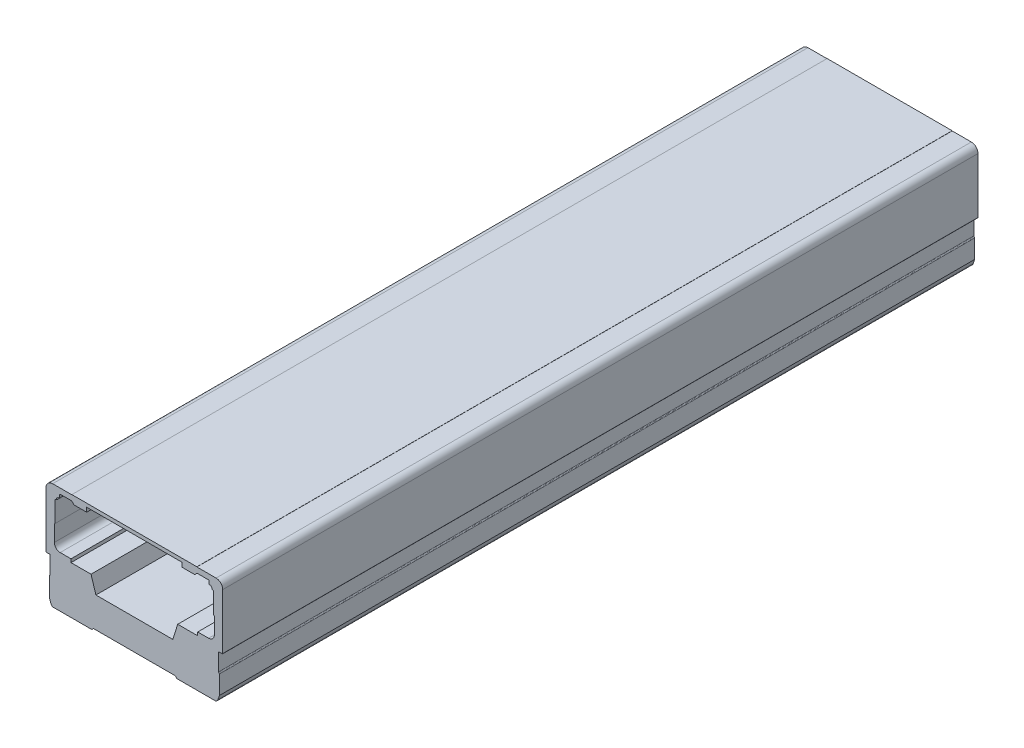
ISO-10303-21;
HEADER;
FILE_DESCRIPTION(('STEP AP214'),'2;1');
FILE_NAME('part.step','',(''),(''),'','','');
FILE_SCHEMA(('AUTOMOTIVE_DESIGN { 1 0 10303 214 1 1 1 1 }'));
ENDSEC;
DATA;
#1=APPLICATION_CONTEXT('core data for automotive mechanical design processes');
#2=APPLICATION_PROTOCOL_DEFINITION('international standard','automotive_design',2000,#1);
#3=PRODUCT_CONTEXT('',#1,'mechanical');
#4=PRODUCT('Part','Part','',(#3));
#5=PRODUCT_RELATED_PRODUCT_CATEGORY('part','',(#4));
#6=PRODUCT_DEFINITION_FORMATION('','',#4);
#7=PRODUCT_DEFINITION_CONTEXT('part definition',#1,'design');
#8=PRODUCT_DEFINITION('design','',#6,#7);
#9=PRODUCT_DEFINITION_SHAPE('','',#8);
#10=(LENGTH_UNIT() NAMED_UNIT(*) SI_UNIT(.MILLI.,.METRE.));
#11=(NAMED_UNIT(*) PLANE_ANGLE_UNIT() SI_UNIT($,.RADIAN.));
#12=(NAMED_UNIT(*) SI_UNIT($,.STERADIAN.) SOLID_ANGLE_UNIT());
#13=UNCERTAINTY_MEASURE_WITH_UNIT(LENGTH_MEASURE(1.E-05),#10,'distance_accuracy_value','');
#14=(GEOMETRIC_REPRESENTATION_CONTEXT(3) GLOBAL_UNCERTAINTY_ASSIGNED_CONTEXT((#13)) GLOBAL_UNIT_ASSIGNED_CONTEXT((#10,
#11,#12)) REPRESENTATION_CONTEXT('',''));
#15=CARTESIAN_POINT('',(0.,0.,0.));
#16=DIRECTION('',(0.,0.,1.));
#17=DIRECTION('',(1.,0.,0.));
#18=AXIS2_PLACEMENT_3D('',#15,#16,#17);
#19=CARTESIAN_POINT('',(-48.9999999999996,40.8371486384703,453.));
#20=DIRECTION('',(0.,0.,1.));
#21=DIRECTION('',(1.,0.,0.));
#22=AXIS2_PLACEMENT_3D('',#19,#20,#21);
#23=PLANE('',#22);
#24=DIRECTION('',(-1.,0.,0.));
#25=VECTOR('',#24,1.);
#26=CARTESIAN_POINT('',(49.0000000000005,44.8371486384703,453.));
#27=LINE('',#26,#25);
#28=CARTESIAN_POINT('',(49.0000000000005,44.8371486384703,453.));
#29=VERTEX_POINT('',#28);
#30=CARTESIAN_POINT('',(37.5000000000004,44.8371486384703,453.));
#31=VERTEX_POINT('',#30);
#32=EDGE_CURVE('E840',#29,#31,#27,.T.);
#33=ORIENTED_EDGE('',*,*,#32,.T.);
#34=DIRECTION('',(0.,1.,0.));
#35=VECTOR('',#34,1.);
#36=CARTESIAN_POINT('',(37.5000000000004,44.8371486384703,453.));
#37=LINE('',#36,#35);
#38=CARTESIAN_POINT('',(37.5000000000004,44.9371486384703,453.));
#39=VERTEX_POINT('',#38);
#40=EDGE_CURVE('E843',#31,#39,#37,.T.);
#41=ORIENTED_EDGE('',*,*,#40,.T.);
#42=DIRECTION('',(-1.,0.,0.));
#43=VECTOR('',#42,1.);
#44=CARTESIAN_POINT('',(37.5000000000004,44.9371486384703,453.));
#45=LINE('',#44,#43);
#46=CARTESIAN_POINT('',(-37.4999999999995,44.9371486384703,453.));
#47=VERTEX_POINT('',#46);
#48=EDGE_CURVE('E846',#39,#47,#45,.T.);
#49=ORIENTED_EDGE('',*,*,#48,.T.);
#50=DIRECTION('',(0.,-1.,0.));
#51=VECTOR('',#50,1.);
#52=CARTESIAN_POINT('',(-37.4999999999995,44.9371486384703,453.));
#53=LINE('',#52,#51);
#54=CARTESIAN_POINT('',(-37.4999999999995,44.8371486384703,453.));
#55=VERTEX_POINT('',#54);
#56=EDGE_CURVE('E848',#47,#55,#53,.T.);
#57=ORIENTED_EDGE('',*,*,#56,.T.);
#58=DIRECTION('',(-1.,0.,0.));
#59=VECTOR('',#58,1.);
#60=CARTESIAN_POINT('',(-37.4999999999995,44.8371486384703,453.));
#61=LINE('',#60,#59);
#62=CARTESIAN_POINT('',(-48.9999999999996,44.8371486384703,453.));
#63=VERTEX_POINT('',#62);
#64=EDGE_CURVE('E850',#55,#63,#61,.T.);
#65=ORIENTED_EDGE('',*,*,#64,.T.);
#66=CARTESIAN_POINT('',(-48.9999999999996,40.8371486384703,453.));
#67=DIRECTION('',(0.,0.,1.));
#68=DIRECTION('',(1.,0.,0.));
#69=AXIS2_PLACEMENT_3D('',#66,#67,#68);
#70=CIRCLE('',#69,4.);
#71=CARTESIAN_POINT('',(-52.9999999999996,40.8371486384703,453.));
#72=VERTEX_POINT('',#71);
#73=EDGE_CURVE('E852',#63,#72,#70,.T.);
#74=ORIENTED_EDGE('',*,*,#73,.T.);
#75=DIRECTION('',(0.,-1.,0.));
#76=VECTOR('',#75,1.);
#77=CARTESIAN_POINT('',(-52.9999999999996,40.8371486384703,453.));
#78=LINE('',#77,#76);
#79=CARTESIAN_POINT('',(-52.9999999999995,7.63714863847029,453.));
#80=VERTEX_POINT('',#79);
#81=EDGE_CURVE('E854',#72,#80,#78,.T.);
#82=ORIENTED_EDGE('',*,*,#81,.T.);
#83=CARTESIAN_POINT('',(-52.6999999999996,7.63714863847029,453.));
#84=DIRECTION('',(0.,0.,1.));
#85=DIRECTION('',(1.,0.,0.));
#86=AXIS2_PLACEMENT_3D('',#83,#84,#85);
#87=CIRCLE('',#86,0.299999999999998);
#88=CARTESIAN_POINT('',(-52.6999999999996,7.3371486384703,453.));
#89=VERTEX_POINT('',#88);
#90=EDGE_CURVE('E856',#80,#89,#87,.T.);
#91=ORIENTED_EDGE('',*,*,#90,.T.);
#92=DIRECTION('',(1.,0.,0.));
#93=VECTOR('',#92,1.);
#94=CARTESIAN_POINT('',(-52.6999999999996,7.33714863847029,453.));
#95=LINE('',#94,#93);
#96=CARTESIAN_POINT('',(-50.4999999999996,7.33714863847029,453.));
#97=VERTEX_POINT('',#96);
#98=EDGE_CURVE('E858',#89,#97,#95,.T.);
#99=ORIENTED_EDGE('',*,*,#98,.T.);
#100=DIRECTION('',(0.,-1.,0.));
#101=VECTOR('',#100,1.);
#102=CARTESIAN_POINT('',(-50.4999999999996,7.33714863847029,453.));
#103=LINE('',#102,#101);
#104=CARTESIAN_POINT('',(-50.4999999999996,-3.16285136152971,453.));
#105=VERTEX_POINT('',#104);
#106=EDGE_CURVE('E860',#97,#105,#103,.T.);
#107=ORIENTED_EDGE('',*,*,#106,.T.);
#108=CARTESIAN_POINT('',(-50.9999999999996,-3.16285136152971,453.));
#109=DIRECTION('',(0.,0.,-1.));
#110=DIRECTION('',(1.,0.,0.));
#111=AXIS2_PLACEMENT_3D('',#108,#109,#110);
#112=CIRCLE('',#111,0.49999999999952);
#113=CARTESIAN_POINT('',(-50.7499999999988,-3.59586406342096,453.));
#114=VERTEX_POINT('',#113);
#115=EDGE_CURVE('E862',#105,#114,#112,.T.);
#116=ORIENTED_EDGE('',*,*,#115,.T.);
#117=CARTESIAN_POINT('',(-50.4999999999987,-4.02887676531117,453.));
#118=DIRECTION('',(0.,0.,1.));
#119=DIRECTION('',(1.,0.,0.));
#120=AXIS2_PLACEMENT_3D('',#117,#118,#119);
#121=CIRCLE('',#120,0.499999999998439);
#122=CARTESIAN_POINT('',(-50.9999999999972,-4.02887676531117,453.));
#123=VERTEX_POINT('',#122);
#124=EDGE_CURVE('E864',#114,#123,#121,.T.);
#125=ORIENTED_EDGE('',*,*,#124,.T.);
#126=DIRECTION('',(0.,-1.,0.));
#127=VECTOR('',#126,1.);
#128=CARTESIAN_POINT('',(-50.9999999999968,-4.02887676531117,453.));
#129=LINE('',#128,#127);
#130=CARTESIAN_POINT('',(-50.9999999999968,-15.1628513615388,453.));
#131=VERTEX_POINT('',#130);
#132=EDGE_CURVE('E866',#123,#131,#129,.T.);
#133=ORIENTED_EDGE('',*,*,#132,.T.);
#134=DIRECTION('',(0.325568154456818,-0.945518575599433,0.));
#135=VECTOR('',#134,1.);
#136=CARTESIAN_POINT('',(-50.9999999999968,-15.1628513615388,453.));
#137=LINE('',#136,#135);
#138=CARTESIAN_POINT('',(-50.1378012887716,-17.6668582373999,453.));
#139=VERTEX_POINT('',#138);
#140=EDGE_CURVE('E868',#131,#139,#137,.T.);
#141=ORIENTED_EDGE('',*,*,#140,.T.);
#142=CARTESIAN_POINT('',(-47.3012455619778,-16.6901537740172,453.));
#143=DIRECTION('',(0.,0.,1.));
#144=DIRECTION('',(1.,0.,0.));
#145=AXIS2_PLACEMENT_3D('',#142,#143,#144);
#146=CIRCLE('',#145,2.99999999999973);
#147=CARTESIAN_POINT('',(-48.9999999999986,-19.1628513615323,453.));
#148=VERTEX_POINT('',#147);
#149=EDGE_CURVE('E870',#139,#148,#146,.T.);
#150=ORIENTED_EDGE('',*,*,#149,.T.);
#151=DIRECTION('',(1.,0.,0.));
#152=VECTOR('',#151,1.);
#153=CARTESIAN_POINT('',(-48.9999999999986,-19.1628513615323,453.));
#154=LINE('',#153,#152);
#155=CARTESIAN_POINT('',(-25.4999999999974,-19.1628513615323,453.));
#156=VERTEX_POINT('',#155);
#157=EDGE_CURVE('E872',#148,#156,#154,.T.);
#158=ORIENTED_EDGE('',*,*,#157,.T.);
#159=DIRECTION('',(0.707106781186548,0.707106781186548,0.));
#160=VECTOR('',#159,1.);
#161=CARTESIAN_POINT('',(-25.4999999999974,-19.1628513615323,453.));
#162=LINE('',#161,#160);
#163=CARTESIAN_POINT('',(-24.4999999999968,-18.1628513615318,453.));
#164=VERTEX_POINT('',#163);
#165=EDGE_CURVE('E874',#156,#164,#162,.T.);
#166=ORIENTED_EDGE('',*,*,#165,.T.);
#167=DIRECTION('',(1.,0.,0.));
#168=VECTOR('',#167,1.);
#169=CARTESIAN_POINT('',(-24.4999999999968,-18.1628513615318,453.));
#170=LINE('',#169,#168);
#171=CARTESIAN_POINT('',(24.5000000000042,-18.1628513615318,453.));
#172=VERTEX_POINT('',#171);
#173=EDGE_CURVE('E876',#164,#172,#170,.T.);
#174=ORIENTED_EDGE('',*,*,#173,.T.);
#175=DIRECTION('',(0.707106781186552,-0.707106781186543,0.));
#176=VECTOR('',#175,1.);
#177=CARTESIAN_POINT('',(24.5000000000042,-18.1628513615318,453.));
#178=LINE('',#177,#176);
#179=CARTESIAN_POINT('',(25.5000000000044,-19.162851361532,453.));
#180=VERTEX_POINT('',#179);
#181=EDGE_CURVE('E878',#172,#180,#178,.T.);
#182=ORIENTED_EDGE('',*,*,#181,.T.);
#183=DIRECTION('',(1.,0.,0.));
#184=VECTOR('',#183,1.);
#185=CARTESIAN_POINT('',(25.5000000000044,-19.162851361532,453.));
#186=LINE('',#185,#184);
#187=CARTESIAN_POINT('',(49.0000000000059,-19.162851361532,453.));
#188=VERTEX_POINT('',#187);
#189=EDGE_CURVE('E880',#180,#188,#186,.T.);
#190=ORIENTED_EDGE('',*,*,#189,.T.);
#191=CARTESIAN_POINT('',(47.3012453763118,-16.6901535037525,453.));
#192=DIRECTION('',(0.,0.,1.));
#193=DIRECTION('',(1.,0.,0.));
#194=AXIS2_PLACEMENT_3D('',#191,#192,#193);
#195=CIRCLE('',#194,3.0000003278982);
#196=CARTESIAN_POINT('',(50.1365073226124,-17.6706083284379,453.));
#197=VERTEX_POINT('',#196);
#198=EDGE_CURVE('E882',#188,#197,#195,.T.);
#199=ORIENTED_EDGE('',*,*,#198,.T.);
#200=DIRECTION('',(0.325568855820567,0.945518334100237,0.));
#201=VECTOR('',#200,1.);
#202=CARTESIAN_POINT('',(50.1365073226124,-17.6706083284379,453.));
#203=LINE('',#202,#201);
#204=CARTESIAN_POINT('',(50.9999995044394,-15.1628509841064,453.));
#205=VERTEX_POINT('',#204);
#206=EDGE_CURVE('E884',#197,#205,#203,.T.);
#207=ORIENTED_EDGE('',*,*,#206,.T.);
#208=DIRECTION('',(0.,1.,0.));
#209=VECTOR('',#208,1.);
#210=CARTESIAN_POINT('',(50.9999995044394,-15.1628509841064,453.));
#211=LINE('',#210,#209);
#212=CARTESIAN_POINT('',(50.9999995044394,-4.02887638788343,453.));
#213=VERTEX_POINT('',#212);
#214=EDGE_CURVE('E886',#205,#213,#211,.T.);
#215=ORIENTED_EDGE('',*,*,#214,.T.);
#216=CARTESIAN_POINT('',(50.4999995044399,-4.02887638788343,453.));
#217=DIRECTION('',(0.,0.,1.));
#218=DIRECTION('',(1.,0.,0.));
#219=AXIS2_PLACEMENT_3D('',#216,#217,#218);
#220=CIRCLE('',#219,0.499999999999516);
#221=CARTESIAN_POINT('',(50.7499995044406,-3.59586368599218,453.));
#222=VERTEX_POINT('',#221);
#223=EDGE_CURVE('E888',#213,#222,#220,.T.);
#224=ORIENTED_EDGE('',*,*,#223,.T.);
#225=CARTESIAN_POINT('',(50.9999995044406,-3.16285098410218,453.));
#226=DIRECTION('',(0.,0.,-1.));
#227=DIRECTION('',(1.,0.,0.));
#228=AXIS2_PLACEMENT_3D('',#225,#226,#227);
#229=CIRCLE('',#228,0.499999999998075);
#230=CARTESIAN_POINT('',(50.4999995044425,-3.16285098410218,453.));
#231=VERTEX_POINT('',#230);
#232=EDGE_CURVE('E890',#222,#231,#229,.T.);
#233=ORIENTED_EDGE('',*,*,#232,.T.);
#234=DIRECTION('',(0.,1.,0.));
#235=VECTOR('',#234,1.);
#236=CARTESIAN_POINT('',(50.4999995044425,-3.16285098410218,453.));
#237=LINE('',#236,#235);
#238=CARTESIAN_POINT('',(50.4999995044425,7.33714863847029,453.));
#239=VERTEX_POINT('',#238);
#240=EDGE_CURVE('E892',#231,#239,#237,.T.);
#241=ORIENTED_EDGE('',*,*,#240,.T.);
#242=DIRECTION('',(1.,0.,0.));
#243=VECTOR('',#242,1.);
#244=CARTESIAN_POINT('',(50.4999995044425,7.33714863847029,453.));
#245=LINE('',#244,#243);
#246=CARTESIAN_POINT('',(52.7000000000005,7.33714863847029,453.));
#247=VERTEX_POINT('',#246);
#248=EDGE_CURVE('E894',#239,#247,#245,.T.);
#249=ORIENTED_EDGE('',*,*,#248,.T.);
#250=CARTESIAN_POINT('',(52.7000000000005,7.63714863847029,453.));
#251=DIRECTION('',(0.,0.,1.));
#252=DIRECTION('',(1.,0.,0.));
#253=AXIS2_PLACEMENT_3D('',#250,#251,#252);
#254=CIRCLE('',#253,0.300000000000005);
#255=CARTESIAN_POINT('',(53.0000000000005,7.63714863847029,453.));
#256=VERTEX_POINT('',#255);
#257=EDGE_CURVE('E896',#247,#256,#254,.T.);
#258=ORIENTED_EDGE('',*,*,#257,.T.);
#259=DIRECTION('',(0.,1.,0.));
#260=VECTOR('',#259,1.);
#261=CARTESIAN_POINT('',(53.0000000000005,7.63714863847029,453.));
#262=LINE('',#261,#260);
#263=CARTESIAN_POINT('',(53.0000000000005,40.8371486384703,453.));
#264=VERTEX_POINT('',#263);
#265=EDGE_CURVE('E898',#256,#264,#262,.T.);
#266=ORIENTED_EDGE('',*,*,#265,.T.);
#267=CARTESIAN_POINT('',(49.0000000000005,40.8371486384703,453.));
#268=DIRECTION('',(0.,0.,1.));
#269=DIRECTION('',(1.,0.,0.));
#270=AXIS2_PLACEMENT_3D('',#267,#268,#269);
#271=CIRCLE('',#270,4.);
#272=EDGE_CURVE('E900',#264,#29,#271,.T.);
#273=ORIENTED_EDGE('',*,*,#272,.T.);
#274=EDGE_LOOP('',(#33,#41,#49,#57,#65,#74,#82,#91,#99,#107,#116,#125,#133,#141,#150,#158,#166,
#174,#182,#190,#199,#207,#215,#224,#233,#241,#249,#258,#266,#273));
#275=FACE_BOUND('',#274,.T.);
#276=CARTESIAN_POINT('',(-44.4999999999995,14.8371486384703,453.));
#277=DIRECTION('',(0.,0.,1.));
#278=DIRECTION('',(1.,0.,0.));
#279=AXIS2_PLACEMENT_3D('',#276,#277,#278);
#280=CIRCLE('',#279,3.5);
#281=CARTESIAN_POINT('',(-47.9999999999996,14.8371486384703,453.));
#282=VERTEX_POINT('',#281);
#283=CARTESIAN_POINT('',(-44.4999999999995,11.3371486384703,453.));
#284=VERTEX_POINT('',#283);
#285=EDGE_CURVE('E550',#282,#284,#280,.T.);
#286=ORIENTED_EDGE('',*,*,#285,.F.);
#287=DIRECTION('',(0.,-1.,0.));
#288=VECTOR('',#287,1.);
#289=CARTESIAN_POINT('',(-47.9999999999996,24.5371486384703,453.));
#290=LINE('',#289,#288);
#291=CARTESIAN_POINT('',(-47.9999999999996,24.5371486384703,453.));
#292=VERTEX_POINT('',#291);
#293=EDGE_CURVE('E548',#292,#282,#290,.T.);
#294=ORIENTED_EDGE('',*,*,#293,.F.);
#295=DIRECTION('',(-0.799999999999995,-0.600000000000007,0.));
#296=VECTOR('',#295,1.);
#297=CARTESIAN_POINT('',(-47.5999999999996,24.8371486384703,453.));
#298=LINE('',#297,#296);
#299=CARTESIAN_POINT('',(-47.5999999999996,24.8371486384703,453.));
#300=VERTEX_POINT('',#299);
#301=EDGE_CURVE('E631',#300,#292,#298,.T.);
#302=ORIENTED_EDGE('',*,*,#301,.F.);
#303=DIRECTION('',(0.,-1.,0.));
#304=VECTOR('',#303,1.);
#305=CARTESIAN_POINT('',(-47.5999999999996,37.0752473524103,453.));
#306=LINE('',#305,#304);
#307=CARTESIAN_POINT('',(-47.5999999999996,37.0752473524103,453.));
#308=VERTEX_POINT('',#307);
#309=EDGE_CURVE('E629',#308,#300,#306,.T.);
#310=ORIENTED_EDGE('',*,*,#309,.F.);
#311=CARTESIAN_POINT('',(-47.0999999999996,37.0752473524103,453.));
#312=DIRECTION('',(0.,0.,1.));
#313=DIRECTION('',(1.,0.,0.));
#314=AXIS2_PLACEMENT_3D('',#311,#312,#313);
#315=CIRCLE('',#314,0.500000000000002);
#316=CARTESIAN_POINT('',(-47.1757575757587,37.5694748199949,453.));
#317=VERTEX_POINT('',#316);
#318=EDGE_CURVE('E627',#317,#308,#315,.T.);
#319=ORIENTED_EDGE('',*,*,#318,.F.);
#320=CARTESIAN_POINT('',(-47.5999999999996,40.3371486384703,453.));
#321=DIRECTION('',(0.,0.,-1.));
#322=DIRECTION('',(1.,0.,0.));
#323=AXIS2_PLACEMENT_3D('',#320,#321,#322);
#324=CIRCLE('',#323,2.79999999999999);
#325=CARTESIAN_POINT('',(-46.4577825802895,37.7807176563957,453.));
#326=VERTEX_POINT('',#325);
#327=EDGE_CURVE('E625',#326,#317,#324,.T.);
#328=ORIENTED_EDGE('',*,*,#327,.F.);
#329=DIRECTION('',(0.349665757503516,-0.936874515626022,0.));
#330=VECTOR('',#329,1.);
#331=CARTESIAN_POINT('',(-46.7382941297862,38.5323043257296,453.));
#332=LINE('',#331,#330);
#333=CARTESIAN_POINT('',(-46.7382941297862,38.5323043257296,453.));
#334=VERTEX_POINT('',#333);
#335=EDGE_CURVE('E623',#334,#326,#332,.T.);
#336=ORIENTED_EDGE('',*,*,#335,.F.);
#337=CARTESIAN_POINT('',(-47.5999999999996,40.3371486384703,453.));
#338=DIRECTION('',(0.,0.,-1.));
#339=DIRECTION('',(1.,0.,0.));
#340=AXIS2_PLACEMENT_3D('',#337,#338,#339);
#341=CIRCLE('',#340,1.99999999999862);
#342=CARTESIAN_POINT('',(-45.7951556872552,39.4754427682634,453.));
#343=VERTEX_POINT('',#342);
#344=EDGE_CURVE('E621',#343,#334,#341,.T.);
#345=ORIENTED_EDGE('',*,*,#344,.F.);
#346=DIRECTION('',(-0.936874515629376,0.349665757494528,0.));
#347=VECTOR('',#346,1.);
#348=CARTESIAN_POINT('',(-45.0435690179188,39.194931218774,453.));
#349=LINE('',#348,#347);
#350=CARTESIAN_POINT('',(-45.0435690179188,39.194931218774,453.));
#351=VERTEX_POINT('',#350);
#352=EDGE_CURVE('E619',#351,#343,#349,.T.);
#353=ORIENTED_EDGE('',*,*,#352,.F.);
#354=CARTESIAN_POINT('',(-47.5999999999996,40.3371486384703,453.));
#355=DIRECTION('',(0.,0.,-1.));
#356=DIRECTION('',(1.,0.,0.));
#357=AXIS2_PLACEMENT_3D('',#354,#355,#356);
#358=CIRCLE('',#357,2.8);
#359=CARTESIAN_POINT('',(-44.7999999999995,40.3371486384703,453.));
#360=VERTEX_POINT('',#359);
#361=EDGE_CURVE('E617',#360,#351,#358,.T.);
#362=ORIENTED_EDGE('',*,*,#361,.F.);
#363=DIRECTION('',(0.,-1.,0.));
#364=VECTOR('',#363,1.);
#365=CARTESIAN_POINT('',(-44.7999999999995,41.1371486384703,453.));
#366=LINE('',#365,#364);
#367=CARTESIAN_POINT('',(-44.7999999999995,41.1371486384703,453.));
#368=VERTEX_POINT('',#367);
#369=EDGE_CURVE('E615',#368,#360,#366,.T.);
#370=ORIENTED_EDGE('',*,*,#369,.F.);
#371=CARTESIAN_POINT('',(-44.2999999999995,41.1371486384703,453.));
#372=DIRECTION('',(0.,0.,1.));
#373=DIRECTION('',(1.,0.,0.));
#374=AXIS2_PLACEMENT_3D('',#371,#372,#373);
#375=CIRCLE('',#374,0.5);
#376=CARTESIAN_POINT('',(-44.2999999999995,41.6371486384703,453.));
#377=VERTEX_POINT('',#376);
#378=EDGE_CURVE('E613',#377,#368,#375,.T.);
#379=ORIENTED_EDGE('',*,*,#378,.F.);
#380=DIRECTION('',(-1.,0.,0.));
#381=VECTOR('',#380,1.);
#382=CARTESIAN_POINT('',(-37.5999999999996,41.6371486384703,453.));
#383=LINE('',#382,#381);
#384=CARTESIAN_POINT('',(-37.5999999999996,41.6371486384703,453.));
#385=VERTEX_POINT('',#384);
#386=EDGE_CURVE('E611',#385,#377,#383,.T.);
#387=ORIENTED_EDGE('',*,*,#386,.F.);
#388=DIRECTION('',(-0.707106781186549,0.707106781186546,0.));
#389=VECTOR('',#388,1.);
#390=CARTESIAN_POINT('',(-36.1999999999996,40.2371486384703,453.));
#391=LINE('',#390,#389);
#392=CARTESIAN_POINT('',(-36.1999999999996,40.2371486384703,453.));
#393=VERTEX_POINT('',#392);
#394=EDGE_CURVE('E609',#393,#385,#391,.T.);
#395=ORIENTED_EDGE('',*,*,#394,.F.);
#396=DIRECTION('',(-1.,0.,0.));
#397=VECTOR('',#396,1.);
#398=CARTESIAN_POINT('',(-28.5999999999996,40.2371486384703,453.));
#399=LINE('',#398,#397);
#400=CARTESIAN_POINT('',(-28.5999999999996,40.2371486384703,453.));
#401=VERTEX_POINT('',#400);
#402=EDGE_CURVE('E607',#401,#393,#399,.T.);
#403=ORIENTED_EDGE('',*,*,#402,.F.);
#404=DIRECTION('',(0.,-1.,0.));
#405=VECTOR('',#404,1.);
#406=CARTESIAN_POINT('',(-28.5999999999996,42.8371486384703,453.));
#407=LINE('',#406,#405);
#408=CARTESIAN_POINT('',(-28.5999999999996,42.8371486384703,453.));
#409=VERTEX_POINT('',#408);
#410=EDGE_CURVE('E605',#409,#401,#407,.T.);
#411=ORIENTED_EDGE('',*,*,#410,.F.);
#412=DIRECTION('',(-1.,0.,0.));
#413=VECTOR('',#412,1.);
#414=CARTESIAN_POINT('',(28.6000000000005,42.8371486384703,453.));
#415=LINE('',#414,#413);
#416=CARTESIAN_POINT('',(28.6000000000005,42.8371486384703,453.));
#417=VERTEX_POINT('',#416);
#418=EDGE_CURVE('E603',#417,#409,#415,.T.);
#419=ORIENTED_EDGE('',*,*,#418,.F.);
#420=DIRECTION('',(0.,1.,0.));
#421=VECTOR('',#420,1.);
#422=CARTESIAN_POINT('',(28.6000000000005,40.2371486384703,453.));
#423=LINE('',#422,#421);
#424=CARTESIAN_POINT('',(28.6000000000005,40.2371486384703,453.));
#425=VERTEX_POINT('',#424);
#426=EDGE_CURVE('E601',#425,#417,#423,.T.);
#427=ORIENTED_EDGE('',*,*,#426,.F.);
#428=DIRECTION('',(-1.,0.,0.));
#429=VECTOR('',#428,1.);
#430=CARTESIAN_POINT('',(36.2000000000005,40.2371486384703,453.));
#431=LINE('',#430,#429);
#432=CARTESIAN_POINT('',(36.2000000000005,40.2371486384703,453.));
#433=VERTEX_POINT('',#432);
#434=EDGE_CURVE('E599',#433,#425,#431,.T.);
#435=ORIENTED_EDGE('',*,*,#434,.F.);
#436=DIRECTION('',(-0.707106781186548,-0.707106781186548,0.));
#437=VECTOR('',#436,1.);
#438=CARTESIAN_POINT('',(37.6000000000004,41.6371486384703,453.));
#439=LINE('',#438,#437);
#440=CARTESIAN_POINT('',(37.6000000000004,41.6371486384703,453.));
#441=VERTEX_POINT('',#440);
#442=EDGE_CURVE('E597',#441,#433,#439,.T.);
#443=ORIENTED_EDGE('',*,*,#442,.F.);
#444=DIRECTION('',(-1.,0.,0.));
#445=VECTOR('',#444,1.);
#446=CARTESIAN_POINT('',(44.3000000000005,41.6371486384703,453.));
#447=LINE('',#446,#445);
#448=CARTESIAN_POINT('',(44.3000000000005,41.6371486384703,453.));
#449=VERTEX_POINT('',#448);
#450=EDGE_CURVE('E595',#449,#441,#447,.T.);
#451=ORIENTED_EDGE('',*,*,#450,.F.);
#452=CARTESIAN_POINT('',(44.3000000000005,41.1371486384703,453.));
#453=DIRECTION('',(0.,0.,1.));
#454=DIRECTION('',(1.,0.,0.));
#455=AXIS2_PLACEMENT_3D('',#452,#453,#454);
#456=CIRCLE('',#455,0.5);
#457=CARTESIAN_POINT('',(44.8000000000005,41.1371486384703,453.));
#458=VERTEX_POINT('',#457);
#459=EDGE_CURVE('E593',#458,#449,#456,.T.);
#460=ORIENTED_EDGE('',*,*,#459,.F.);
#461=DIRECTION('',(0.,1.,0.));
#462=VECTOR('',#461,1.);
#463=CARTESIAN_POINT('',(44.8000000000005,40.3371486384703,453.));
#464=LINE('',#463,#462);
#465=CARTESIAN_POINT('',(44.8000000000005,40.3371486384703,453.));
#466=VERTEX_POINT('',#465);
#467=EDGE_CURVE('E591',#466,#458,#464,.T.);
#468=ORIENTED_EDGE('',*,*,#467,.F.);
#469=CARTESIAN_POINT('',(47.6000000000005,40.3371486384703,453.));
#470=DIRECTION('',(0.,0.,-1.));
#471=DIRECTION('',(1.,0.,0.));
#472=AXIS2_PLACEMENT_3D('',#469,#470,#471);
#473=CIRCLE('',#472,2.8);
#474=CARTESIAN_POINT('',(45.0435690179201,39.1949312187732,453.));
#475=VERTEX_POINT('',#474);
#476=EDGE_CURVE('E589',#475,#466,#473,.T.);
#477=ORIENTED_EDGE('',*,*,#476,.F.);
#478=DIRECTION('',(-0.936874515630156,-0.349665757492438,0.));
#479=VECTOR('',#478,1.);
#480=CARTESIAN_POINT('',(45.795155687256,39.4754427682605,453.));
#481=LINE('',#480,#479);
#482=CARTESIAN_POINT('',(45.795155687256,39.4754427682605,453.));
#483=VERTEX_POINT('',#482);
#484=EDGE_CURVE('E587',#483,#475,#481,.T.);
#485=ORIENTED_EDGE('',*,*,#484,.F.);
#486=CARTESIAN_POINT('',(47.6000000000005,40.3371486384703,453.));
#487=DIRECTION('',(0.,0.,-1.));
#488=DIRECTION('',(1.,0.,0.));
#489=AXIS2_PLACEMENT_3D('',#486,#487,#488);
#490=CIRCLE('',#489,1.9999999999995);
#491=CARTESIAN_POINT('',(46.7382941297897,38.5323043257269,453.));
#492=VERTEX_POINT('',#491);
#493=EDGE_CURVE('E585',#492,#483,#490,.T.);
#494=ORIENTED_EDGE('',*,*,#493,.F.);
#495=DIRECTION('',(0.349665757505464,0.936874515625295,0.));
#496=VECTOR('',#495,1.);
#497=CARTESIAN_POINT('',(46.457782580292,37.780717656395,453.));
#498=LINE('',#497,#496);
#499=CARTESIAN_POINT('',(46.457782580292,37.780717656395,453.));
#500=VERTEX_POINT('',#499);
#501=EDGE_CURVE('E583',#500,#492,#498,.T.);
#502=ORIENTED_EDGE('',*,*,#501,.F.);
#503=CARTESIAN_POINT('',(47.6000000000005,40.3371486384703,453.));
#504=DIRECTION('',(0.,0.,-1.));
#505=DIRECTION('',(1.,0.,0.));
#506=AXIS2_PLACEMENT_3D('',#503,#504,#505);
#507=CIRCLE('',#506,2.8);
#508=CARTESIAN_POINT('',(47.1757575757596,37.5694748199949,453.));
#509=VERTEX_POINT('',#508);
#510=EDGE_CURVE('E581',#509,#500,#507,.T.);
#511=ORIENTED_EDGE('',*,*,#510,.F.);
#512=CARTESIAN_POINT('',(47.1000000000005,37.0752473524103,453.));
#513=DIRECTION('',(0.,0.,1.));
#514=DIRECTION('',(1.,0.,0.));
#515=AXIS2_PLACEMENT_3D('',#512,#513,#514);
#516=CIRCLE('',#515,0.499999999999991);
#517=CARTESIAN_POINT('',(47.6000000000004,37.0752473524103,453.));
#518=VERTEX_POINT('',#517);
#519=EDGE_CURVE('E579',#518,#509,#516,.T.);
#520=ORIENTED_EDGE('',*,*,#519,.F.);
#521=DIRECTION('',(0.,1.,0.));
#522=VECTOR('',#521,1.);
#523=CARTESIAN_POINT('',(47.6000000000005,24.8371486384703,453.));
#524=LINE('',#523,#522);
#525=CARTESIAN_POINT('',(47.6000000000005,24.8371486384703,453.));
#526=VERTEX_POINT('',#525);
#527=EDGE_CURVE('E577',#526,#518,#524,.T.);
#528=ORIENTED_EDGE('',*,*,#527,.F.);
#529=DIRECTION('',(-0.799999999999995,0.600000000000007,0.));
#530=VECTOR('',#529,1.);
#531=CARTESIAN_POINT('',(48.0000000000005,24.5371486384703,453.));
#532=LINE('',#531,#530);
#533=CARTESIAN_POINT('',(48.0000000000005,24.5371486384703,453.));
#534=VERTEX_POINT('',#533);
#535=EDGE_CURVE('E575',#534,#526,#532,.T.);
#536=ORIENTED_EDGE('',*,*,#535,.F.);
#537=DIRECTION('',(0.,1.,0.));
#538=VECTOR('',#537,1.);
#539=CARTESIAN_POINT('',(48.0000000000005,14.8371486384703,453.));
#540=LINE('',#539,#538);
#541=CARTESIAN_POINT('',(48.0000000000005,14.8371486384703,453.));
#542=VERTEX_POINT('',#541);
#543=EDGE_CURVE('E573',#542,#534,#540,.T.);
#544=ORIENTED_EDGE('',*,*,#543,.F.);
#545=CARTESIAN_POINT('',(44.5000000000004,14.8371486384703,453.));
#546=DIRECTION('',(0.,0.,1.));
#547=DIRECTION('',(1.,0.,0.));
#548=AXIS2_PLACEMENT_3D('',#545,#546,#547);
#549=CIRCLE('',#548,3.5);
#550=CARTESIAN_POINT('',(44.5000000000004,11.3371486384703,453.));
#551=VERTEX_POINT('',#550);
#552=EDGE_CURVE('E571',#551,#542,#549,.T.);
#553=ORIENTED_EDGE('',*,*,#552,.F.);
#554=DIRECTION('',(1.,0.,0.));
#555=VECTOR('',#554,1.);
#556=CARTESIAN_POINT('',(38.0000000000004,11.3371486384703,453.));
#557=LINE('',#556,#555);
#558=CARTESIAN_POINT('',(38.0000000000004,11.3371486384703,453.));
#559=VERTEX_POINT('',#558);
#560=EDGE_CURVE('E569',#559,#551,#557,.T.);
#561=ORIENTED_EDGE('',*,*,#560,.F.);
#562=DIRECTION('',(0.,1.,0.));
#563=VECTOR('',#562,1.);
#564=CARTESIAN_POINT('',(38.0000000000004,9.33714863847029,453.));
#565=LINE('',#564,#563);
#566=CARTESIAN_POINT('',(38.0000000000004,9.33714863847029,453.));
#567=VERTEX_POINT('',#566);
#568=EDGE_CURVE('E567',#567,#559,#565,.T.);
#569=ORIENTED_EDGE('',*,*,#568,.F.);
#570=DIRECTION('',(1.,0.,0.));
#571=VECTOR('',#570,1.);
#572=CARTESIAN_POINT('',(26.0000000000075,9.33714863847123,453.));
#573=LINE('',#572,#571);
#574=CARTESIAN_POINT('',(26.0000000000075,9.33714863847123,453.));
#575=VERTEX_POINT('',#574);
#576=EDGE_CURVE('E565',#575,#567,#573,.T.);
#577=ORIENTED_EDGE('',*,*,#576,.F.);
#578=DIRECTION('',(0.300705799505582,0.953716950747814,0.));
#579=VECTOR('',#578,1.);
#580=CARTESIAN_POINT('',(23.0560083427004,2.84494650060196E-13,453.));
#581=LINE('',#580,#579);
#582=CARTESIAN_POINT('',(23.0560083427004,2.84494650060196E-13,453.));
#583=VERTEX_POINT('',#582);
#584=EDGE_CURVE('E563',#583,#575,#581,.T.);
#585=ORIENTED_EDGE('',*,*,#584,.F.);
#586=DIRECTION('',(1.,0.,0.));
#587=VECTOR('',#586,1.);
#588=CARTESIAN_POINT('',(-23.0560083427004,0.,453.));
#589=LINE('',#588,#587);
#590=CARTESIAN_POINT('',(-23.0560083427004,0.,453.));
#591=VERTEX_POINT('',#590);
#592=EDGE_CURVE('E561',#591,#583,#589,.T.);
#593=ORIENTED_EDGE('',*,*,#592,.F.);
#594=DIRECTION('',(0.300705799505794,-0.953716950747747,0.));
#595=VECTOR('',#594,1.);
#596=CARTESIAN_POINT('',(-26.0000000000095,9.33714863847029,453.));
#597=LINE('',#596,#595);
#598=CARTESIAN_POINT('',(-26.0000000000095,9.33714863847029,453.));
#599=VERTEX_POINT('',#598);
#600=EDGE_CURVE('E559',#599,#591,#597,.T.);
#601=ORIENTED_EDGE('',*,*,#600,.F.);
#602=DIRECTION('',(1.,0.,0.));
#603=VECTOR('',#602,1.);
#604=CARTESIAN_POINT('',(-37.9999999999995,9.33714863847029,453.));
#605=LINE('',#604,#603);
#606=CARTESIAN_POINT('',(-37.9999999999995,9.33714863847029,453.));
#607=VERTEX_POINT('',#606);
#608=EDGE_CURVE('E557',#607,#599,#605,.T.);
#609=ORIENTED_EDGE('',*,*,#608,.F.);
#610=DIRECTION('',(0.,-1.,0.));
#611=VECTOR('',#610,1.);
#612=CARTESIAN_POINT('',(-37.9999999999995,11.3371486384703,453.));
#613=LINE('',#612,#611);
#614=CARTESIAN_POINT('',(-37.9999999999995,11.3371486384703,453.));
#615=VERTEX_POINT('',#614);
#616=EDGE_CURVE('E555',#615,#607,#613,.T.);
#617=ORIENTED_EDGE('',*,*,#616,.F.);
#618=DIRECTION('',(1.,0.,0.));
#619=VECTOR('',#618,1.);
#620=CARTESIAN_POINT('',(-44.4999999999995,11.3371486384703,453.));
#621=LINE('',#620,#619);
#622=EDGE_CURVE('E553',#284,#615,#621,.T.);
#623=ORIENTED_EDGE('',*,*,#622,.F.);
#624=EDGE_LOOP('',(#286,#294,#302,#310,#319,#328,#336,#345,#353,#362,#370,#379,#387,#395,#403,
#411,#419,#427,#435,#443,#451,#460,#468,#477,#485,#494,#502,#511,#520,#528,#536,#544,#553,#561,
#569,#577,#585,#593,#601,#609,#617,#623));
#625=FACE_BOUND('',#624,.T.);
#626=ADVANCED_FACE('F36',(#275,#625),#23,.T.);
#627=CARTESIAN_POINT('',(-48.9999999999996,40.8371486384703,0.));
#628=DIRECTION('',(0.,0.,1.));
#629=DIRECTION('',(1.,0.,0.));
#630=AXIS2_PLACEMENT_3D('',#627,#628,#629);
#631=PLANE('',#630);
#632=DIRECTION('',(-1.,0.,0.));
#633=VECTOR('',#632,1.);
#634=CARTESIAN_POINT('',(49.0000000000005,44.8371486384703,0.));
#635=LINE('',#634,#633);
#636=CARTESIAN_POINT('',(49.0000000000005,44.8371486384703,0.));
#637=VERTEX_POINT('',#636);
#638=CARTESIAN_POINT('',(37.5000000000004,44.8371486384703,0.));
#639=VERTEX_POINT('',#638);
#640=EDGE_CURVE('E839',#637,#639,#635,.T.);
#641=ORIENTED_EDGE('',*,*,#640,.F.);
#642=CARTESIAN_POINT('',(49.0000000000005,40.8371486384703,0.));
#643=DIRECTION('',(0.,0.,1.));
#644=DIRECTION('',(1.,0.,0.));
#645=AXIS2_PLACEMENT_3D('',#642,#643,#644);
#646=CIRCLE('',#645,4.);
#647=CARTESIAN_POINT('',(53.0000000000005,40.8371486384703,0.));
#648=VERTEX_POINT('',#647);
#649=EDGE_CURVE('E844',#648,#637,#646,.T.);
#650=ORIENTED_EDGE('',*,*,#649,.F.);
#651=DIRECTION('',(0.,1.,0.));
#652=VECTOR('',#651,1.);
#653=CARTESIAN_POINT('',(53.0000000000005,7.63714863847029,0.));
#654=LINE('',#653,#652);
#655=CARTESIAN_POINT('',(53.0000000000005,7.63714863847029,0.));
#656=VERTEX_POINT('',#655);
#657=EDGE_CURVE('E959',#656,#648,#654,.T.);
#658=ORIENTED_EDGE('',*,*,#657,.F.);
#659=CARTESIAN_POINT('',(52.7000000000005,7.63714863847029,0.));
#660=DIRECTION('',(0.,0.,1.));
#661=DIRECTION('',(1.,0.,0.));
#662=AXIS2_PLACEMENT_3D('',#659,#660,#661);
#663=CIRCLE('',#662,0.300000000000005);
#664=CARTESIAN_POINT('',(52.7000000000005,7.33714863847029,0.));
#665=VERTEX_POINT('',#664);
#666=EDGE_CURVE('E957',#665,#656,#663,.T.);
#667=ORIENTED_EDGE('',*,*,#666,.F.);
#668=DIRECTION('',(1.,0.,0.));
#669=VECTOR('',#668,1.);
#670=CARTESIAN_POINT('',(50.4999995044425,7.33714863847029,0.));
#671=LINE('',#670,#669);
#672=CARTESIAN_POINT('',(50.4999995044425,7.33714863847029,0.));
#673=VERTEX_POINT('',#672);
#674=EDGE_CURVE('E955',#673,#665,#671,.T.);
#675=ORIENTED_EDGE('',*,*,#674,.F.);
#676=DIRECTION('',(0.,1.,0.));
#677=VECTOR('',#676,1.);
#678=CARTESIAN_POINT('',(50.4999995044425,-3.16285098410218,0.));
#679=LINE('',#678,#677);
#680=CARTESIAN_POINT('',(50.4999995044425,-3.16285098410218,0.));
#681=VERTEX_POINT('',#680);
#682=EDGE_CURVE('E953',#681,#673,#679,.T.);
#683=ORIENTED_EDGE('',*,*,#682,.F.);
#684=CARTESIAN_POINT('',(50.9999995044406,-3.16285098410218,0.));
#685=DIRECTION('',(0.,0.,-1.));
#686=DIRECTION('',(1.,0.,0.));
#687=AXIS2_PLACEMENT_3D('',#684,#685,#686);
#688=CIRCLE('',#687,0.499999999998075);
#689=CARTESIAN_POINT('',(50.7499995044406,-3.59586368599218,0.));
#690=VERTEX_POINT('',#689);
#691=EDGE_CURVE('E951',#690,#681,#688,.T.);
#692=ORIENTED_EDGE('',*,*,#691,.F.);
#693=CARTESIAN_POINT('',(50.4999995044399,-4.02887638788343,0.));
#694=DIRECTION('',(0.,0.,1.));
#695=DIRECTION('',(1.,0.,0.));
#696=AXIS2_PLACEMENT_3D('',#693,#694,#695);
#697=CIRCLE('',#696,0.499999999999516);
#698=CARTESIAN_POINT('',(50.9999995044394,-4.02887638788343,0.));
#699=VERTEX_POINT('',#698);
#700=EDGE_CURVE('E949',#699,#690,#697,.T.);
#701=ORIENTED_EDGE('',*,*,#700,.F.);
#702=DIRECTION('',(0.,1.,0.));
#703=VECTOR('',#702,1.);
#704=CARTESIAN_POINT('',(50.9999995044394,-15.1628509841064,0.));
#705=LINE('',#704,#703);
#706=CARTESIAN_POINT('',(50.9999995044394,-15.1628509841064,0.));
#707=VERTEX_POINT('',#706);
#708=EDGE_CURVE('E947',#707,#699,#705,.T.);
#709=ORIENTED_EDGE('',*,*,#708,.F.);
#710=DIRECTION('',(0.325568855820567,0.945518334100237,0.));
#711=VECTOR('',#710,1.);
#712=CARTESIAN_POINT('',(50.1365073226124,-17.6706083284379,0.));
#713=LINE('',#712,#711);
#714=CARTESIAN_POINT('',(50.1365073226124,-17.6706083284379,0.));
#715=VERTEX_POINT('',#714);
#716=EDGE_CURVE('E945',#715,#707,#713,.T.);
#717=ORIENTED_EDGE('',*,*,#716,.F.);
#718=CARTESIAN_POINT('',(47.3012453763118,-16.6901535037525,0.));
#719=DIRECTION('',(0.,0.,1.));
#720=DIRECTION('',(1.,0.,0.));
#721=AXIS2_PLACEMENT_3D('',#718,#719,#720);
#722=CIRCLE('',#721,3.0000003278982);
#723=CARTESIAN_POINT('',(49.0000000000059,-19.162851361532,0.));
#724=VERTEX_POINT('',#723);
#725=EDGE_CURVE('E943',#724,#715,#722,.T.);
#726=ORIENTED_EDGE('',*,*,#725,.F.);
#727=DIRECTION('',(1.,0.,0.));
#728=VECTOR('',#727,1.);
#729=CARTESIAN_POINT('',(25.5000000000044,-19.162851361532,0.));
#730=LINE('',#729,#728);
#731=CARTESIAN_POINT('',(25.5000000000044,-19.162851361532,0.));
#732=VERTEX_POINT('',#731);
#733=EDGE_CURVE('E941',#732,#724,#730,.T.);
#734=ORIENTED_EDGE('',*,*,#733,.F.);
#735=DIRECTION('',(0.707106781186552,-0.707106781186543,0.));
#736=VECTOR('',#735,1.);
#737=CARTESIAN_POINT('',(24.5000000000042,-18.1628513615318,0.));
#738=LINE('',#737,#736);
#739=CARTESIAN_POINT('',(24.5000000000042,-18.1628513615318,0.));
#740=VERTEX_POINT('',#739);
#741=EDGE_CURVE('E939',#740,#732,#738,.T.);
#742=ORIENTED_EDGE('',*,*,#741,.F.);
#743=DIRECTION('',(1.,0.,0.));
#744=VECTOR('',#743,1.);
#745=CARTESIAN_POINT('',(-24.4999999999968,-18.1628513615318,0.));
#746=LINE('',#745,#744);
#747=CARTESIAN_POINT('',(-24.4999999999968,-18.1628513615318,0.));
#748=VERTEX_POINT('',#747);
#749=EDGE_CURVE('E937',#748,#740,#746,.T.);
#750=ORIENTED_EDGE('',*,*,#749,.F.);
#751=DIRECTION('',(0.707106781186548,0.707106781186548,0.));
#752=VECTOR('',#751,1.);
#753=CARTESIAN_POINT('',(-25.4999999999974,-19.1628513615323,0.));
#754=LINE('',#753,#752);
#755=CARTESIAN_POINT('',(-25.4999999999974,-19.1628513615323,0.));
#756=VERTEX_POINT('',#755);
#757=EDGE_CURVE('E935',#756,#748,#754,.T.);
#758=ORIENTED_EDGE('',*,*,#757,.F.);
#759=DIRECTION('',(1.,0.,0.));
#760=VECTOR('',#759,1.);
#761=CARTESIAN_POINT('',(-48.9999999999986,-19.1628513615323,0.));
#762=LINE('',#761,#760);
#763=CARTESIAN_POINT('',(-48.9999999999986,-19.1628513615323,0.));
#764=VERTEX_POINT('',#763);
#765=EDGE_CURVE('E933',#764,#756,#762,.T.);
#766=ORIENTED_EDGE('',*,*,#765,.F.);
#767=CARTESIAN_POINT('',(-47.3012455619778,-16.6901537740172,0.));
#768=DIRECTION('',(0.,0.,1.));
#769=DIRECTION('',(1.,0.,0.));
#770=AXIS2_PLACEMENT_3D('',#767,#768,#769);
#771=CIRCLE('',#770,2.99999999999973);
#772=CARTESIAN_POINT('',(-50.1378012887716,-17.6668582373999,0.));
#773=VERTEX_POINT('',#772);
#774=EDGE_CURVE('E931',#773,#764,#771,.T.);
#775=ORIENTED_EDGE('',*,*,#774,.F.);
#776=DIRECTION('',(0.325568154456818,-0.945518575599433,0.));
#777=VECTOR('',#776,1.);
#778=CARTESIAN_POINT('',(-50.9999999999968,-15.1628513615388,0.));
#779=LINE('',#778,#777);
#780=CARTESIAN_POINT('',(-50.9999999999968,-15.1628513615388,0.));
#781=VERTEX_POINT('',#780);
#782=EDGE_CURVE('E929',#781,#773,#779,.T.);
#783=ORIENTED_EDGE('',*,*,#782,.F.);
#784=DIRECTION('',(0.,-1.,0.));
#785=VECTOR('',#784,1.);
#786=CARTESIAN_POINT('',(-50.9999999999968,-4.02887676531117,0.));
#787=LINE('',#786,#785);
#788=CARTESIAN_POINT('',(-50.9999999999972,-4.02887676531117,0.));
#789=VERTEX_POINT('',#788);
#790=EDGE_CURVE('E927',#789,#781,#787,.T.);
#791=ORIENTED_EDGE('',*,*,#790,.F.);
#792=CARTESIAN_POINT('',(-50.4999999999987,-4.02887676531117,0.));
#793=DIRECTION('',(0.,0.,1.));
#794=DIRECTION('',(1.,0.,0.));
#795=AXIS2_PLACEMENT_3D('',#792,#793,#794);
#796=CIRCLE('',#795,0.499999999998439);
#797=CARTESIAN_POINT('',(-50.7499999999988,-3.59586406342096,0.));
#798=VERTEX_POINT('',#797);
#799=EDGE_CURVE('E925',#798,#789,#796,.T.);
#800=ORIENTED_EDGE('',*,*,#799,.F.);
#801=CARTESIAN_POINT('',(-50.9999999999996,-3.16285136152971,0.));
#802=DIRECTION('',(0.,0.,-1.));
#803=DIRECTION('',(1.,0.,0.));
#804=AXIS2_PLACEMENT_3D('',#801,#802,#803);
#805=CIRCLE('',#804,0.49999999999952);
#806=CARTESIAN_POINT('',(-50.4999999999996,-3.16285136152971,0.));
#807=VERTEX_POINT('',#806);
#808=EDGE_CURVE('E923',#807,#798,#805,.T.);
#809=ORIENTED_EDGE('',*,*,#808,.F.);
#810=DIRECTION('',(0.,-1.,0.));
#811=VECTOR('',#810,1.);
#812=CARTESIAN_POINT('',(-50.4999999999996,7.33714863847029,0.));
#813=LINE('',#812,#811);
#814=CARTESIAN_POINT('',(-50.4999999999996,7.33714863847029,0.));
#815=VERTEX_POINT('',#814);
#816=EDGE_CURVE('E921',#815,#807,#813,.T.);
#817=ORIENTED_EDGE('',*,*,#816,.F.);
#818=DIRECTION('',(1.,0.,0.));
#819=VECTOR('',#818,1.);
#820=CARTESIAN_POINT('',(-52.6999999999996,7.33714863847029,0.));
#821=LINE('',#820,#819);
#822=CARTESIAN_POINT('',(-52.6999999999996,7.3371486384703,0.));
#823=VERTEX_POINT('',#822);
#824=EDGE_CURVE('E919',#823,#815,#821,.T.);
#825=ORIENTED_EDGE('',*,*,#824,.F.);
#826=CARTESIAN_POINT('',(-52.6999999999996,7.63714863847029,0.));
#827=DIRECTION('',(0.,0.,1.));
#828=DIRECTION('',(1.,0.,0.));
#829=AXIS2_PLACEMENT_3D('',#826,#827,#828);
#830=CIRCLE('',#829,0.299999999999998);
#831=CARTESIAN_POINT('',(-52.9999999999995,7.63714863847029,0.));
#832=VERTEX_POINT('',#831);
#833=EDGE_CURVE('E917',#832,#823,#830,.T.);
#834=ORIENTED_EDGE('',*,*,#833,.F.);
#835=DIRECTION('',(0.,-1.,0.));
#836=VECTOR('',#835,1.);
#837=CARTESIAN_POINT('',(-52.9999999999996,40.8371486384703,0.));
#838=LINE('',#837,#836);
#839=CARTESIAN_POINT('',(-52.9999999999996,40.8371486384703,0.));
#840=VERTEX_POINT('',#839);
#841=EDGE_CURVE('E915',#840,#832,#838,.T.);
#842=ORIENTED_EDGE('',*,*,#841,.F.);
#843=CARTESIAN_POINT('',(-48.9999999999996,40.8371486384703,0.));
#844=DIRECTION('',(0.,0.,1.));
#845=DIRECTION('',(1.,0.,0.));
#846=AXIS2_PLACEMENT_3D('',#843,#844,#845);
#847=CIRCLE('',#846,4.);
#848=CARTESIAN_POINT('',(-48.9999999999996,44.8371486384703,0.));
#849=VERTEX_POINT('',#848);
#850=EDGE_CURVE('E913',#849,#840,#847,.T.);
#851=ORIENTED_EDGE('',*,*,#850,.F.);
#852=DIRECTION('',(-1.,0.,0.));
#853=VECTOR('',#852,1.);
#854=CARTESIAN_POINT('',(-37.4999999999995,44.8371486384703,0.));
#855=LINE('',#854,#853);
#856=CARTESIAN_POINT('',(-37.4999999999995,44.8371486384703,0.));
#857=VERTEX_POINT('',#856);
#858=EDGE_CURVE('E911',#857,#849,#855,.T.);
#859=ORIENTED_EDGE('',*,*,#858,.F.);
#860=DIRECTION('',(0.,-1.,0.));
#861=VECTOR('',#860,1.);
#862=CARTESIAN_POINT('',(-37.4999999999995,44.9371486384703,0.));
#863=LINE('',#862,#861);
#864=CARTESIAN_POINT('',(-37.4999999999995,44.9371486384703,0.));
#865=VERTEX_POINT('',#864);
#866=EDGE_CURVE('E909',#865,#857,#863,.T.);
#867=ORIENTED_EDGE('',*,*,#866,.F.);
#868=DIRECTION('',(-1.,0.,0.));
#869=VECTOR('',#868,1.);
#870=CARTESIAN_POINT('',(37.5000000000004,44.9371486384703,0.));
#871=LINE('',#870,#869);
#872=CARTESIAN_POINT('',(37.5000000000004,44.9371486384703,0.));
#873=VERTEX_POINT('',#872);
#874=EDGE_CURVE('E907',#873,#865,#871,.T.);
#875=ORIENTED_EDGE('',*,*,#874,.F.);
#876=DIRECTION('',(0.,1.,0.));
#877=VECTOR('',#876,1.);
#878=CARTESIAN_POINT('',(37.5000000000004,44.8371486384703,0.));
#879=LINE('',#878,#877);
#880=EDGE_CURVE('E905',#639,#873,#879,.T.);
#881=ORIENTED_EDGE('',*,*,#880,.F.);
#882=EDGE_LOOP('',(#641,#650,#658,#667,#675,#683,#692,#701,#709,#717,#726,#734,#742,#750,#758,
#766,#775,#783,#791,#800,#809,#817,#825,#834,#842,#851,#859,#867,#875,#881));
#883=FACE_BOUND('',#882,.T.);
#884=DIRECTION('',(0.,-1.,0.));
#885=VECTOR('',#884,1.);
#886=CARTESIAN_POINT('',(-47.9999999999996,24.5371486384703,0.));
#887=LINE('',#886,#885);
#888=CARTESIAN_POINT('',(-47.9999999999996,24.5371486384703,0.));
#889=VERTEX_POINT('',#888);
#890=CARTESIAN_POINT('',(-47.9999999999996,14.8371486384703,0.));
#891=VERTEX_POINT('',#890);
#892=EDGE_CURVE('E59',#889,#891,#887,.T.);
#893=ORIENTED_EDGE('',*,*,#892,.T.);
#894=CARTESIAN_POINT('',(-44.4999999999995,14.8371486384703,0.));
#895=DIRECTION('',(0.,0.,1.));
#896=DIRECTION('',(1.,0.,0.));
#897=AXIS2_PLACEMENT_3D('',#894,#895,#896);
#898=CIRCLE('',#897,3.5);
#899=CARTESIAN_POINT('',(-44.4999999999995,11.3371486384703,0.));
#900=VERTEX_POINT('',#899);
#901=EDGE_CURVE('E635',#891,#900,#898,.T.);
#902=ORIENTED_EDGE('',*,*,#901,.T.);
#903=DIRECTION('',(1.,0.,0.));
#904=VECTOR('',#903,1.);
#905=CARTESIAN_POINT('',(-44.4999999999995,11.3371486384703,0.));
#906=LINE('',#905,#904);
#907=CARTESIAN_POINT('',(-37.9999999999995,11.3371486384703,0.));
#908=VERTEX_POINT('',#907);
#909=EDGE_CURVE('E638',#900,#908,#906,.T.);
#910=ORIENTED_EDGE('',*,*,#909,.T.);
#911=DIRECTION('',(0.,-1.,0.));
#912=VECTOR('',#911,1.);
#913=CARTESIAN_POINT('',(-37.9999999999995,11.3371486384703,0.));
#914=LINE('',#913,#912);
#915=CARTESIAN_POINT('',(-37.9999999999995,9.33714863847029,0.));
#916=VERTEX_POINT('',#915);
#917=EDGE_CURVE('E641',#908,#916,#914,.T.);
#918=ORIENTED_EDGE('',*,*,#917,.T.);
#919=DIRECTION('',(1.,0.,0.));
#920=VECTOR('',#919,1.);
#921=CARTESIAN_POINT('',(-37.9999999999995,9.33714863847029,0.));
#922=LINE('',#921,#920);
#923=CARTESIAN_POINT('',(-26.0000000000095,9.33714863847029,0.));
#924=VERTEX_POINT('',#923);
#925=EDGE_CURVE('E644',#916,#924,#922,.T.);
#926=ORIENTED_EDGE('',*,*,#925,.T.);
#927=DIRECTION('',(0.300705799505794,-0.953716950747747,0.));
#928=VECTOR('',#927,1.);
#929=CARTESIAN_POINT('',(-26.0000000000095,9.33714863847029,0.));
#930=LINE('',#929,#928);
#931=CARTESIAN_POINT('',(-23.0560083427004,0.,0.));
#932=VERTEX_POINT('',#931);
#933=EDGE_CURVE('E647',#924,#932,#930,.T.);
#934=ORIENTED_EDGE('',*,*,#933,.T.);
#935=DIRECTION('',(1.,0.,0.));
#936=VECTOR('',#935,1.);
#937=CARTESIAN_POINT('',(-23.0560083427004,0.,0.));
#938=LINE('',#937,#936);
#939=CARTESIAN_POINT('',(23.0560083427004,2.84494650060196E-13,0.));
#940=VERTEX_POINT('',#939);
#941=EDGE_CURVE('E650',#932,#940,#938,.T.);
#942=ORIENTED_EDGE('',*,*,#941,.T.);
#943=DIRECTION('',(0.300705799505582,0.953716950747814,0.));
#944=VECTOR('',#943,1.);
#945=CARTESIAN_POINT('',(23.0560083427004,2.84494650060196E-13,0.));
#946=LINE('',#945,#944);
#947=CARTESIAN_POINT('',(26.0000000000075,9.33714863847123,0.));
#948=VERTEX_POINT('',#947);
#949=EDGE_CURVE('E653',#940,#948,#946,.T.);
#950=ORIENTED_EDGE('',*,*,#949,.T.);
#951=DIRECTION('',(1.,0.,0.));
#952=VECTOR('',#951,1.);
#953=CARTESIAN_POINT('',(26.0000000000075,9.33714863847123,0.));
#954=LINE('',#953,#952);
#955=CARTESIAN_POINT('',(38.0000000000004,9.33714863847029,0.));
#956=VERTEX_POINT('',#955);
#957=EDGE_CURVE('E656',#948,#956,#954,.T.);
#958=ORIENTED_EDGE('',*,*,#957,.T.);
#959=DIRECTION('',(0.,1.,0.));
#960=VECTOR('',#959,1.);
#961=CARTESIAN_POINT('',(38.0000000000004,9.33714863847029,0.));
#962=LINE('',#961,#960);
#963=CARTESIAN_POINT('',(38.0000000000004,11.3371486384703,0.));
#964=VERTEX_POINT('',#963);
#965=EDGE_CURVE('E659',#956,#964,#962,.T.);
#966=ORIENTED_EDGE('',*,*,#965,.T.);
#967=DIRECTION('',(1.,0.,0.));
#968=VECTOR('',#967,1.);
#969=CARTESIAN_POINT('',(38.0000000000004,11.3371486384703,0.));
#970=LINE('',#969,#968);
#971=CARTESIAN_POINT('',(44.5000000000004,11.3371486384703,0.));
#972=VERTEX_POINT('',#971);
#973=EDGE_CURVE('E662',#964,#972,#970,.T.);
#974=ORIENTED_EDGE('',*,*,#973,.T.);
#975=CARTESIAN_POINT('',(44.5000000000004,14.8371486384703,0.));
#976=DIRECTION('',(0.,0.,1.));
#977=DIRECTION('',(1.,0.,0.));
#978=AXIS2_PLACEMENT_3D('',#975,#976,#977);
#979=CIRCLE('',#978,3.5);
#980=CARTESIAN_POINT('',(48.0000000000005,14.8371486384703,0.));
#981=VERTEX_POINT('',#980);
#982=EDGE_CURVE('E665',#972,#981,#979,.T.);
#983=ORIENTED_EDGE('',*,*,#982,.T.);
#984=DIRECTION('',(0.,1.,0.));
#985=VECTOR('',#984,1.);
#986=CARTESIAN_POINT('',(48.0000000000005,14.8371486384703,0.));
#987=LINE('',#986,#985);
#988=CARTESIAN_POINT('',(48.0000000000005,24.5371486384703,0.));
#989=VERTEX_POINT('',#988);
#990=EDGE_CURVE('E668',#981,#989,#987,.T.);
#991=ORIENTED_EDGE('',*,*,#990,.T.);
#992=DIRECTION('',(-0.799999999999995,0.600000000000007,0.));
#993=VECTOR('',#992,1.);
#994=CARTESIAN_POINT('',(48.0000000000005,24.5371486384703,0.));
#995=LINE('',#994,#993);
#996=CARTESIAN_POINT('',(47.6000000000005,24.8371486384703,0.));
#997=VERTEX_POINT('',#996);
#998=EDGE_CURVE('E671',#989,#997,#995,.T.);
#999=ORIENTED_EDGE('',*,*,#998,.T.);
#1000=DIRECTION('',(0.,1.,0.));
#1001=VECTOR('',#1000,1.);
#1002=CARTESIAN_POINT('',(47.6000000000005,24.8371486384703,0.));
#1003=LINE('',#1002,#1001);
#1004=CARTESIAN_POINT('',(47.6000000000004,37.0752473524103,0.));
#1005=VERTEX_POINT('',#1004);
#1006=EDGE_CURVE('E674',#997,#1005,#1003,.T.);
#1007=ORIENTED_EDGE('',*,*,#1006,.T.);
#1008=CARTESIAN_POINT('',(47.1000000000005,37.0752473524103,0.));
#1009=DIRECTION('',(0.,0.,1.));
#1010=DIRECTION('',(1.,0.,0.));
#1011=AXIS2_PLACEMENT_3D('',#1008,#1009,#1010);
#1012=CIRCLE('',#1011,0.499999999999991);
#1013=CARTESIAN_POINT('',(47.1757575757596,37.5694748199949,0.));
#1014=VERTEX_POINT('',#1013);
#1015=EDGE_CURVE('E677',#1005,#1014,#1012,.T.);
#1016=ORIENTED_EDGE('',*,*,#1015,.T.);
#1017=CARTESIAN_POINT('',(47.6000000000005,40.3371486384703,0.));
#1018=DIRECTION('',(0.,0.,-1.));
#1019=DIRECTION('',(1.,0.,0.));
#1020=AXIS2_PLACEMENT_3D('',#1017,#1018,#1019);
#1021=CIRCLE('',#1020,2.8);
#1022=CARTESIAN_POINT('',(46.457782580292,37.780717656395,0.));
#1023=VERTEX_POINT('',#1022);
#1024=EDGE_CURVE('E680',#1014,#1023,#1021,.T.);
#1025=ORIENTED_EDGE('',*,*,#1024,.T.);
#1026=DIRECTION('',(0.349665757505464,0.936874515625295,0.));
#1027=VECTOR('',#1026,1.);
#1028=CARTESIAN_POINT('',(46.457782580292,37.780717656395,0.));
#1029=LINE('',#1028,#1027);
#1030=CARTESIAN_POINT('',(46.7382941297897,38.5323043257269,0.));
#1031=VERTEX_POINT('',#1030);
#1032=EDGE_CURVE('E683',#1023,#1031,#1029,.T.);
#1033=ORIENTED_EDGE('',*,*,#1032,.T.);
#1034=CARTESIAN_POINT('',(47.6000000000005,40.3371486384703,0.));
#1035=DIRECTION('',(0.,0.,-1.));
#1036=DIRECTION('',(1.,0.,0.));
#1037=AXIS2_PLACEMENT_3D('',#1034,#1035,#1036);
#1038=CIRCLE('',#1037,1.9999999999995);
#1039=CARTESIAN_POINT('',(45.795155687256,39.4754427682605,0.));
#1040=VERTEX_POINT('',#1039);
#1041=EDGE_CURVE('E686',#1031,#1040,#1038,.T.);
#1042=ORIENTED_EDGE('',*,*,#1041,.T.);
#1043=DIRECTION('',(-0.936874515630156,-0.349665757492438,0.));
#1044=VECTOR('',#1043,1.);
#1045=CARTESIAN_POINT('',(45.795155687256,39.4754427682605,0.));
#1046=LINE('',#1045,#1044);
#1047=CARTESIAN_POINT('',(45.0435690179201,39.1949312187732,0.));
#1048=VERTEX_POINT('',#1047);
#1049=EDGE_CURVE('E689',#1040,#1048,#1046,.T.);
#1050=ORIENTED_EDGE('',*,*,#1049,.T.);
#1051=CARTESIAN_POINT('',(47.6000000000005,40.3371486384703,0.));
#1052=DIRECTION('',(0.,0.,-1.));
#1053=DIRECTION('',(1.,0.,0.));
#1054=AXIS2_PLACEMENT_3D('',#1051,#1052,#1053);
#1055=CIRCLE('',#1054,2.8);
#1056=CARTESIAN_POINT('',(44.8000000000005,40.3371486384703,0.));
#1057=VERTEX_POINT('',#1056);
#1058=EDGE_CURVE('E692',#1048,#1057,#1055,.T.);
#1059=ORIENTED_EDGE('',*,*,#1058,.T.);
#1060=DIRECTION('',(0.,1.,0.));
#1061=VECTOR('',#1060,1.);
#1062=CARTESIAN_POINT('',(44.8000000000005,40.3371486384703,0.));
#1063=LINE('',#1062,#1061);
#1064=CARTESIAN_POINT('',(44.8000000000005,41.1371486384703,0.));
#1065=VERTEX_POINT('',#1064);
#1066=EDGE_CURVE('E695',#1057,#1065,#1063,.T.);
#1067=ORIENTED_EDGE('',*,*,#1066,.T.);
#1068=CARTESIAN_POINT('',(44.3000000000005,41.1371486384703,0.));
#1069=DIRECTION('',(0.,0.,1.));
#1070=DIRECTION('',(1.,0.,0.));
#1071=AXIS2_PLACEMENT_3D('',#1068,#1069,#1070);
#1072=CIRCLE('',#1071,0.5);
#1073=CARTESIAN_POINT('',(44.3000000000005,41.6371486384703,0.));
#1074=VERTEX_POINT('',#1073);
#1075=EDGE_CURVE('E698',#1065,#1074,#1072,.T.);
#1076=ORIENTED_EDGE('',*,*,#1075,.T.);
#1077=DIRECTION('',(-1.,0.,0.));
#1078=VECTOR('',#1077,1.);
#1079=CARTESIAN_POINT('',(44.3000000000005,41.6371486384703,0.));
#1080=LINE('',#1079,#1078);
#1081=CARTESIAN_POINT('',(37.6000000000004,41.6371486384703,0.));
#1082=VERTEX_POINT('',#1081);
#1083=EDGE_CURVE('E701',#1074,#1082,#1080,.T.);
#1084=ORIENTED_EDGE('',*,*,#1083,.T.);
#1085=DIRECTION('',(-0.707106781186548,-0.707106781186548,0.));
#1086=VECTOR('',#1085,1.);
#1087=CARTESIAN_POINT('',(37.6000000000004,41.6371486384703,0.));
#1088=LINE('',#1087,#1086);
#1089=CARTESIAN_POINT('',(36.2000000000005,40.2371486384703,0.));
#1090=VERTEX_POINT('',#1089);
#1091=EDGE_CURVE('E704',#1082,#1090,#1088,.T.);
#1092=ORIENTED_EDGE('',*,*,#1091,.T.);
#1093=DIRECTION('',(-1.,0.,0.));
#1094=VECTOR('',#1093,1.);
#1095=CARTESIAN_POINT('',(36.2000000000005,40.2371486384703,0.));
#1096=LINE('',#1095,#1094);
#1097=CARTESIAN_POINT('',(28.6000000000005,40.2371486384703,0.));
#1098=VERTEX_POINT('',#1097);
#1099=EDGE_CURVE('E707',#1090,#1098,#1096,.T.);
#1100=ORIENTED_EDGE('',*,*,#1099,.T.);
#1101=DIRECTION('',(0.,1.,0.));
#1102=VECTOR('',#1101,1.);
#1103=CARTESIAN_POINT('',(28.6000000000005,40.2371486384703,0.));
#1104=LINE('',#1103,#1102);
#1105=CARTESIAN_POINT('',(28.6000000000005,42.8371486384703,0.));
#1106=VERTEX_POINT('',#1105);
#1107=EDGE_CURVE('E710',#1098,#1106,#1104,.T.);
#1108=ORIENTED_EDGE('',*,*,#1107,.T.);
#1109=DIRECTION('',(-1.,0.,0.));
#1110=VECTOR('',#1109,1.);
#1111=CARTESIAN_POINT('',(28.6000000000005,42.8371486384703,0.));
#1112=LINE('',#1111,#1110);
#1113=CARTESIAN_POINT('',(-28.5999999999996,42.8371486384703,0.));
#1114=VERTEX_POINT('',#1113);
#1115=EDGE_CURVE('E713',#1106,#1114,#1112,.T.);
#1116=ORIENTED_EDGE('',*,*,#1115,.T.);
#1117=DIRECTION('',(0.,-1.,0.));
#1118=VECTOR('',#1117,1.);
#1119=CARTESIAN_POINT('',(-28.5999999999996,42.8371486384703,0.));
#1120=LINE('',#1119,#1118);
#1121=CARTESIAN_POINT('',(-28.5999999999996,40.2371486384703,0.));
#1122=VERTEX_POINT('',#1121);
#1123=EDGE_CURVE('E716',#1114,#1122,#1120,.T.);
#1124=ORIENTED_EDGE('',*,*,#1123,.T.);
#1125=DIRECTION('',(-1.,0.,0.));
#1126=VECTOR('',#1125,1.);
#1127=CARTESIAN_POINT('',(-28.5999999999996,40.2371486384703,0.));
#1128=LINE('',#1127,#1126);
#1129=CARTESIAN_POINT('',(-36.1999999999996,40.2371486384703,0.));
#1130=VERTEX_POINT('',#1129);
#1131=EDGE_CURVE('E719',#1122,#1130,#1128,.T.);
#1132=ORIENTED_EDGE('',*,*,#1131,.T.);
#1133=DIRECTION('',(-0.707106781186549,0.707106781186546,0.));
#1134=VECTOR('',#1133,1.);
#1135=CARTESIAN_POINT('',(-36.1999999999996,40.2371486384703,0.));
#1136=LINE('',#1135,#1134);
#1137=CARTESIAN_POINT('',(-37.5999999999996,41.6371486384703,0.));
#1138=VERTEX_POINT('',#1137);
#1139=EDGE_CURVE('E722',#1130,#1138,#1136,.T.);
#1140=ORIENTED_EDGE('',*,*,#1139,.T.);
#1141=DIRECTION('',(-1.,0.,0.));
#1142=VECTOR('',#1141,1.);
#1143=CARTESIAN_POINT('',(-37.5999999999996,41.6371486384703,0.));
#1144=LINE('',#1143,#1142);
#1145=CARTESIAN_POINT('',(-44.2999999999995,41.6371486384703,0.));
#1146=VERTEX_POINT('',#1145);
#1147=EDGE_CURVE('E725',#1138,#1146,#1144,.T.);
#1148=ORIENTED_EDGE('',*,*,#1147,.T.);
#1149=CARTESIAN_POINT('',(-44.2999999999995,41.1371486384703,0.));
#1150=DIRECTION('',(0.,0.,1.));
#1151=DIRECTION('',(1.,0.,0.));
#1152=AXIS2_PLACEMENT_3D('',#1149,#1150,#1151);
#1153=CIRCLE('',#1152,0.5);
#1154=CARTESIAN_POINT('',(-44.7999999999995,41.1371486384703,0.));
#1155=VERTEX_POINT('',#1154);
#1156=EDGE_CURVE('E728',#1146,#1155,#1153,.T.);
#1157=ORIENTED_EDGE('',*,*,#1156,.T.);
#1158=DIRECTION('',(0.,-1.,0.));
#1159=VECTOR('',#1158,1.);
#1160=CARTESIAN_POINT('',(-44.7999999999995,41.1371486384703,0.));
#1161=LINE('',#1160,#1159);
#1162=CARTESIAN_POINT('',(-44.7999999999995,40.3371486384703,0.));
#1163=VERTEX_POINT('',#1162);
#1164=EDGE_CURVE('E731',#1155,#1163,#1161,.T.);
#1165=ORIENTED_EDGE('',*,*,#1164,.T.);
#1166=CARTESIAN_POINT('',(-47.5999999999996,40.3371486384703,0.));
#1167=DIRECTION('',(0.,0.,-1.));
#1168=DIRECTION('',(1.,0.,0.));
#1169=AXIS2_PLACEMENT_3D('',#1166,#1167,#1168);
#1170=CIRCLE('',#1169,2.8);
#1171=CARTESIAN_POINT('',(-45.0435690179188,39.194931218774,0.));
#1172=VERTEX_POINT('',#1171);
#1173=EDGE_CURVE('E734',#1163,#1172,#1170,.T.);
#1174=ORIENTED_EDGE('',*,*,#1173,.T.);
#1175=DIRECTION('',(-0.936874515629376,0.349665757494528,0.));
#1176=VECTOR('',#1175,1.);
#1177=CARTESIAN_POINT('',(-45.0435690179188,39.194931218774,0.));
#1178=LINE('',#1177,#1176);
#1179=CARTESIAN_POINT('',(-45.7951556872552,39.4754427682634,0.));
#1180=VERTEX_POINT('',#1179);
#1181=EDGE_CURVE('E737',#1172,#1180,#1178,.T.);
#1182=ORIENTED_EDGE('',*,*,#1181,.T.);
#1183=CARTESIAN_POINT('',(-47.5999999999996,40.3371486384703,0.));
#1184=DIRECTION('',(0.,0.,-1.));
#1185=DIRECTION('',(1.,0.,0.));
#1186=AXIS2_PLACEMENT_3D('',#1183,#1184,#1185);
#1187=CIRCLE('',#1186,1.99999999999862);
#1188=CARTESIAN_POINT('',(-46.7382941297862,38.5323043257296,0.));
#1189=VERTEX_POINT('',#1188);
#1190=EDGE_CURVE('E740',#1180,#1189,#1187,.T.);
#1191=ORIENTED_EDGE('',*,*,#1190,.T.);
#1192=DIRECTION('',(0.349665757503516,-0.936874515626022,0.));
#1193=VECTOR('',#1192,1.);
#1194=CARTESIAN_POINT('',(-46.7382941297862,38.5323043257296,0.));
#1195=LINE('',#1194,#1193);
#1196=CARTESIAN_POINT('',(-46.4577825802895,37.7807176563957,0.));
#1197=VERTEX_POINT('',#1196);
#1198=EDGE_CURVE('E743',#1189,#1197,#1195,.T.);
#1199=ORIENTED_EDGE('',*,*,#1198,.T.);
#1200=CARTESIAN_POINT('',(-47.5999999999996,40.3371486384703,0.));
#1201=DIRECTION('',(0.,0.,-1.));
#1202=DIRECTION('',(1.,0.,0.));
#1203=AXIS2_PLACEMENT_3D('',#1200,#1201,#1202);
#1204=CIRCLE('',#1203,2.79999999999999);
#1205=CARTESIAN_POINT('',(-47.1757575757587,37.5694748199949,0.));
#1206=VERTEX_POINT('',#1205);
#1207=EDGE_CURVE('E746',#1197,#1206,#1204,.T.);
#1208=ORIENTED_EDGE('',*,*,#1207,.T.);
#1209=CARTESIAN_POINT('',(-47.0999999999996,37.0752473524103,0.));
#1210=DIRECTION('',(0.,0.,1.));
#1211=DIRECTION('',(1.,0.,0.));
#1212=AXIS2_PLACEMENT_3D('',#1209,#1210,#1211);
#1213=CIRCLE('',#1212,0.500000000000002);
#1214=CARTESIAN_POINT('',(-47.5999999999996,37.0752473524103,0.));
#1215=VERTEX_POINT('',#1214);
#1216=EDGE_CURVE('E749',#1206,#1215,#1213,.T.);
#1217=ORIENTED_EDGE('',*,*,#1216,.T.);
#1218=DIRECTION('',(0.,-1.,0.));
#1219=VECTOR('',#1218,1.);
#1220=CARTESIAN_POINT('',(-47.5999999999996,37.0752473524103,0.));
#1221=LINE('',#1220,#1219);
#1222=CARTESIAN_POINT('',(-47.5999999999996,24.8371486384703,0.));
#1223=VERTEX_POINT('',#1222);
#1224=EDGE_CURVE('E752',#1215,#1223,#1221,.T.);
#1225=ORIENTED_EDGE('',*,*,#1224,.T.);
#1226=DIRECTION('',(-0.799999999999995,-0.600000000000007,0.));
#1227=VECTOR('',#1226,1.);
#1228=CARTESIAN_POINT('',(-47.5999999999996,24.8371486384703,0.));
#1229=LINE('',#1228,#1227);
#1230=EDGE_CURVE('E551',#1223,#889,#1229,.T.);
#1231=ORIENTED_EDGE('',*,*,#1230,.T.);
#1232=EDGE_LOOP('',(#893,#902,#910,#918,#926,#934,#942,#950,#958,#966,#974,#983,#991,#999,#1007,
#1016,#1025,#1033,#1042,#1050,#1059,#1067,#1076,#1084,#1092,#1100,#1108,#1116,#1124,#1132,#1140,
#1148,#1157,#1165,#1174,#1182,#1191,#1199,#1208,#1217,#1225,#1231));
#1233=FACE_BOUND('',#1232,.T.);
#1234=ADVANCED_FACE('F1055',(#883,#1233),#631,.F.);
#1235=CARTESIAN_POINT('',(49.0000000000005,44.8371486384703,453.));
#1236=DIRECTION('',(0.,-1.,0.));
#1237=DIRECTION('',(0.,0.,-1.));
#1238=AXIS2_PLACEMENT_3D('',#1235,#1236,#1237);
#1239=PLANE('',#1238);
#1240=ORIENTED_EDGE('',*,*,#640,.T.);
#1241=DIRECTION('',(0.,0.,-1.));
#1242=VECTOR('',#1241,1.);
#1243=CARTESIAN_POINT('',(37.5000000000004,44.8371486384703,453.));
#1244=LINE('',#1243,#1242);
#1245=EDGE_CURVE('E11',#31,#639,#1244,.T.);
#1246=ORIENTED_EDGE('',*,*,#1245,.F.);
#1247=ORIENTED_EDGE('',*,*,#32,.F.);
#1248=DIRECTION('',(0.,0.,-1.));
#1249=VECTOR('',#1248,1.);
#1250=CARTESIAN_POINT('',(49.0000000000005,44.8371486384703,453.));
#1251=LINE('',#1250,#1249);
#1252=EDGE_CURVE('E902',#29,#637,#1251,.T.);
#1253=ORIENTED_EDGE('',*,*,#1252,.T.);
#1254=EDGE_LOOP('',(#1240,#1246,#1247,#1253));
#1255=FACE_BOUND('',#1254,.T.);
#1256=ADVANCED_FACE('F38',(#1255),#1239,.F.);
#1257=CARTESIAN_POINT('',(37.5000000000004,44.8371486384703,453.));
#1258=DIRECTION('',(-1.,0.,0.));
#1259=DIRECTION('',(0.,0.,1.));
#1260=AXIS2_PLACEMENT_3D('',#1257,#1258,#1259);
#1261=PLANE('',#1260);
#1262=ORIENTED_EDGE('',*,*,#880,.T.);
#1263=DIRECTION('',(0.,0.,-1.));
#1264=VECTOR('',#1263,1.);
#1265=CARTESIAN_POINT('',(37.5000000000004,44.9371486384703,453.));
#1266=LINE('',#1265,#1264);
#1267=EDGE_CURVE('E44',#39,#873,#1266,.T.);
#1268=ORIENTED_EDGE('',*,*,#1267,.F.);
#1269=ORIENTED_EDGE('',*,*,#40,.F.);
#1270=ORIENTED_EDGE('',*,*,#1245,.T.);
#1271=EDGE_LOOP('',(#1262,#1268,#1269,#1270));
#1272=FACE_BOUND('',#1271,.T.);
#1273=ADVANCED_FACE('F1073',(#1272),#1261,.F.);
#1274=CARTESIAN_POINT('',(37.5000000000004,44.9371486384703,453.));
#1275=DIRECTION('',(0.,-1.,0.));
#1276=DIRECTION('',(0.,0.,-1.));
#1277=AXIS2_PLACEMENT_3D('',#1274,#1275,#1276);
#1278=PLANE('',#1277);
#1279=ORIENTED_EDGE('',*,*,#874,.T.);
#1280=DIRECTION('',(0.,0.,-1.));
#1281=VECTOR('',#1280,1.);
#1282=CARTESIAN_POINT('',(-37.4999999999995,44.9371486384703,453.));
#1283=LINE('',#1282,#1281);
#1284=EDGE_CURVE('E1042',#47,#865,#1283,.T.);
#1285=ORIENTED_EDGE('',*,*,#1284,.F.);
#1286=ORIENTED_EDGE('',*,*,#48,.F.);
#1287=ORIENTED_EDGE('',*,*,#1267,.T.);
#1288=EDGE_LOOP('',(#1279,#1285,#1286,#1287));
#1289=FACE_BOUND('',#1288,.T.);
#1290=ADVANCED_FACE('F1049',(#1289),#1278,.F.);
#1291=CARTESIAN_POINT('',(-37.4999999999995,44.9371486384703,453.));
#1292=DIRECTION('',(1.,0.,0.));
#1293=DIRECTION('',(0.,0.,-1.));
#1294=AXIS2_PLACEMENT_3D('',#1291,#1292,#1293);
#1295=PLANE('',#1294);
#1296=ORIENTED_EDGE('',*,*,#866,.T.);
#1297=DIRECTION('',(0.,0.,-1.));
#1298=VECTOR('',#1297,1.);
#1299=CARTESIAN_POINT('',(-37.4999999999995,44.8371486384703,453.));
#1300=LINE('',#1299,#1298);
#1301=EDGE_CURVE('E1039',#55,#857,#1300,.T.);
#1302=ORIENTED_EDGE('',*,*,#1301,.F.);
#1303=ORIENTED_EDGE('',*,*,#56,.F.);
#1304=ORIENTED_EDGE('',*,*,#1284,.T.);
#1305=EDGE_LOOP('',(#1296,#1302,#1303,#1304));
#1306=FACE_BOUND('',#1305,.T.);
#1307=ADVANCED_FACE('F1061',(#1306),#1295,.F.);
#1308=CARTESIAN_POINT('',(-37.4999999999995,44.8371486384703,453.));
#1309=DIRECTION('',(0.,-1.,0.));
#1310=DIRECTION('',(0.,0.,-1.));
#1311=AXIS2_PLACEMENT_3D('',#1308,#1309,#1310);
#1312=PLANE('',#1311);
#1313=ORIENTED_EDGE('',*,*,#858,.T.);
#1314=DIRECTION('',(0.,0.,-1.));
#1315=VECTOR('',#1314,1.);
#1316=CARTESIAN_POINT('',(-48.9999999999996,44.8371486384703,453.));
#1317=LINE('',#1316,#1315);
#1318=EDGE_CURVE('E1036',#63,#849,#1317,.T.);
#1319=ORIENTED_EDGE('',*,*,#1318,.F.);
#1320=ORIENTED_EDGE('',*,*,#64,.F.);
#1321=ORIENTED_EDGE('',*,*,#1301,.T.);
#1322=EDGE_LOOP('',(#1313,#1319,#1320,#1321));
#1323=FACE_BOUND('',#1322,.T.);
#1324=ADVANCED_FACE('F1065',(#1323),#1312,.F.);
#1325=CARTESIAN_POINT('',(-48.9999999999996,40.8371486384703,453.));
#1326=DIRECTION('',(0.,0.,-1.));
#1327=DIRECTION('',(-1.,0.,0.));
#1328=AXIS2_PLACEMENT_3D('',#1325,#1326,#1327);
#1329=CYLINDRICAL_SURFACE('',#1328,4.);
#1330=ORIENTED_EDGE('',*,*,#850,.T.);
#1331=DIRECTION('',(0.,0.,-1.));
#1332=VECTOR('',#1331,1.);
#1333=CARTESIAN_POINT('',(-52.9999999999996,40.8371486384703,453.));
#1334=LINE('',#1333,#1332);
#1335=EDGE_CURVE('E1033',#72,#840,#1334,.T.);
#1336=ORIENTED_EDGE('',*,*,#1335,.F.);
#1337=ORIENTED_EDGE('',*,*,#73,.F.);
#1338=ORIENTED_EDGE('',*,*,#1318,.T.);
#1339=EDGE_LOOP('',(#1330,#1336,#1337,#1338));
#1340=FACE_BOUND('',#1339,.T.);
#1341=ADVANCED_FACE('F1196',(#1340),#1329,.T.);
#1342=CARTESIAN_POINT('',(-52.9999999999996,40.8371486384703,453.));
#1343=DIRECTION('',(1.,0.,0.));
#1344=DIRECTION('',(0.,1.,0.));
#1345=AXIS2_PLACEMENT_3D('',#1342,#1343,#1344);
#1346=PLANE('',#1345);
#1347=ORIENTED_EDGE('',*,*,#841,.T.);
#1348=DIRECTION('',(0.,0.,-1.));
#1349=VECTOR('',#1348,1.);
#1350=CARTESIAN_POINT('',(-52.9999999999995,7.63714863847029,453.));
#1351=LINE('',#1350,#1349);
#1352=EDGE_CURVE('E1030',#80,#832,#1351,.T.);
#1353=ORIENTED_EDGE('',*,*,#1352,.F.);
#1354=ORIENTED_EDGE('',*,*,#81,.F.);
#1355=ORIENTED_EDGE('',*,*,#1335,.T.);
#1356=EDGE_LOOP('',(#1347,#1353,#1354,#1355));
#1357=FACE_BOUND('',#1356,.T.);
#1358=ADVANCED_FACE('F1194',(#1357),#1346,.F.);
#1359=CARTESIAN_POINT('',(-52.6999999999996,7.63714863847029,453.));
#1360=DIRECTION('',(0.,0.,-1.));
#1361=DIRECTION('',(-1.,0.,0.));
#1362=AXIS2_PLACEMENT_3D('',#1359,#1360,#1361);
#1363=CYLINDRICAL_SURFACE('',#1362,0.299999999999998);
#1364=ORIENTED_EDGE('',*,*,#833,.T.);
#1365=DIRECTION('',(0.,0.,-1.));
#1366=VECTOR('',#1365,1.);
#1367=CARTESIAN_POINT('',(-52.6999999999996,7.3371486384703,453.));
#1368=LINE('',#1367,#1366);
#1369=EDGE_CURVE('E1027',#89,#823,#1368,.T.);
#1370=ORIENTED_EDGE('',*,*,#1369,.F.);
#1371=ORIENTED_EDGE('',*,*,#90,.F.);
#1372=ORIENTED_EDGE('',*,*,#1352,.T.);
#1373=EDGE_LOOP('',(#1364,#1370,#1371,#1372));
#1374=FACE_BOUND('',#1373,.T.);
#1375=ADVANCED_FACE('F1190',(#1374),#1363,.T.);
#1376=CARTESIAN_POINT('',(-52.6999999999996,7.33714863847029,453.));
#1377=DIRECTION('',(0.,1.,0.));
#1378=DIRECTION('',(-1.,0.,0.));
#1379=AXIS2_PLACEMENT_3D('',#1376,#1377,#1378);
#1380=PLANE('',#1379);
#1381=ORIENTED_EDGE('',*,*,#824,.T.);
#1382=DIRECTION('',(0.,0.,-1.));
#1383=VECTOR('',#1382,1.);
#1384=CARTESIAN_POINT('',(-50.4999999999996,7.33714863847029,453.));
#1385=LINE('',#1384,#1383);
#1386=EDGE_CURVE('E1024',#97,#815,#1385,.T.);
#1387=ORIENTED_EDGE('',*,*,#1386,.F.);
#1388=ORIENTED_EDGE('',*,*,#98,.F.);
#1389=ORIENTED_EDGE('',*,*,#1369,.T.);
#1390=EDGE_LOOP('',(#1381,#1387,#1388,#1389));
#1391=FACE_BOUND('',#1390,.T.);
#1392=ADVANCED_FACE('F1185',(#1391),#1380,.F.);
#1393=CARTESIAN_POINT('',(-50.4999999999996,7.33714863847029,453.));
#1394=DIRECTION('',(1.,0.,0.));
#1395=DIRECTION('',(0.,1.,0.));
#1396=AXIS2_PLACEMENT_3D('',#1393,#1394,#1395);
#1397=PLANE('',#1396);
#1398=ORIENTED_EDGE('',*,*,#816,.T.);
#1399=DIRECTION('',(0.,0.,-1.));
#1400=VECTOR('',#1399,1.);
#1401=CARTESIAN_POINT('',(-50.4999999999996,-3.16285136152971,453.));
#1402=LINE('',#1401,#1400);
#1403=EDGE_CURVE('E1021',#105,#807,#1402,.T.);
#1404=ORIENTED_EDGE('',*,*,#1403,.F.);
#1405=ORIENTED_EDGE('',*,*,#106,.F.);
#1406=ORIENTED_EDGE('',*,*,#1386,.T.);
#1407=EDGE_LOOP('',(#1398,#1404,#1405,#1406));
#1408=FACE_BOUND('',#1407,.T.);
#1409=ADVANCED_FACE('F1179',(#1408),#1397,.F.);
#1410=CARTESIAN_POINT('',(-50.9999999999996,-3.16285136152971,453.));
#1411=DIRECTION('',(0.,0.,-1.));
#1412=DIRECTION('',(-1.,0.,0.));
#1413=AXIS2_PLACEMENT_3D('',#1410,#1411,#1412);
#1414=CYLINDRICAL_SURFACE('',#1413,0.49999999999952);
#1415=ORIENTED_EDGE('',*,*,#808,.T.);
#1416=DIRECTION('',(0.,0.,-1.));
#1417=VECTOR('',#1416,1.);
#1418=CARTESIAN_POINT('',(-50.7499999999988,-3.59586406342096,453.));
#1419=LINE('',#1418,#1417);
#1420=EDGE_CURVE('E1018',#114,#798,#1419,.T.);
#1421=ORIENTED_EDGE('',*,*,#1420,.F.);
#1422=ORIENTED_EDGE('',*,*,#115,.F.);
#1423=ORIENTED_EDGE('',*,*,#1403,.T.);
#1424=EDGE_LOOP('',(#1415,#1421,#1422,#1423));
#1425=FACE_BOUND('',#1424,.T.);
#1426=ADVANCED_FACE('F1175',(#1425),#1414,.F.);
#1427=CARTESIAN_POINT('',(-50.4999999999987,-4.02887676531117,453.));
#1428=DIRECTION('',(0.,0.,-1.));
#1429=DIRECTION('',(-1.,0.,0.));
#1430=AXIS2_PLACEMENT_3D('',#1427,#1428,#1429);
#1431=CYLINDRICAL_SURFACE('',#1430,0.499999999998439);
#1432=ORIENTED_EDGE('',*,*,#799,.T.);
#1433=DIRECTION('',(0.,0.,-1.));
#1434=VECTOR('',#1433,1.);
#1435=CARTESIAN_POINT('',(-50.9999999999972,-4.02887676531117,453.));
#1436=LINE('',#1435,#1434);
#1437=EDGE_CURVE('E1015',#123,#789,#1436,.T.);
#1438=ORIENTED_EDGE('',*,*,#1437,.F.);
#1439=ORIENTED_EDGE('',*,*,#124,.F.);
#1440=ORIENTED_EDGE('',*,*,#1420,.T.);
#1441=EDGE_LOOP('',(#1432,#1438,#1439,#1440));
#1442=FACE_BOUND('',#1441,.T.);
#1443=ADVANCED_FACE('F1170',(#1442),#1431,.T.);
#1444=CARTESIAN_POINT('',(-50.9999999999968,-4.02887676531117,453.));
#1445=DIRECTION('',(1.,0.,0.));
#1446=DIRECTION('',(0.,0.,-1.));
#1447=AXIS2_PLACEMENT_3D('',#1444,#1445,#1446);
#1448=PLANE('',#1447);
#1449=ORIENTED_EDGE('',*,*,#790,.T.);
#1450=DIRECTION('',(0.,0.,-1.));
#1451=VECTOR('',#1450,1.);
#1452=CARTESIAN_POINT('',(-50.9999999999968,-15.1628513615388,453.));
#1453=LINE('',#1452,#1451);
#1454=EDGE_CURVE('E1012',#131,#781,#1453,.T.);
#1455=ORIENTED_EDGE('',*,*,#1454,.F.);
#1456=ORIENTED_EDGE('',*,*,#132,.F.);
#1457=ORIENTED_EDGE('',*,*,#1437,.T.);
#1458=EDGE_LOOP('',(#1449,#1455,#1456,#1457));
#1459=FACE_BOUND('',#1458,.T.);
#1460=ADVANCED_FACE('F1164',(#1459),#1448,.F.);
#1461=CARTESIAN_POINT('',(-50.9999999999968,-15.1628513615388,453.));
#1462=DIRECTION('',(0.945518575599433,0.325568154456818,0.));
#1463=DIRECTION('',(-0.325568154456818,0.945518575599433,0.));
#1464=AXIS2_PLACEMENT_3D('',#1461,#1462,#1463);
#1465=PLANE('',#1464);
#1466=ORIENTED_EDGE('',*,*,#782,.T.);
#1467=DIRECTION('',(0.,0.,-1.));
#1468=VECTOR('',#1467,1.);
#1469=CARTESIAN_POINT('',(-50.1378012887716,-17.6668582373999,453.));
#1470=LINE('',#1469,#1468);
#1471=EDGE_CURVE('E1009',#139,#773,#1470,.T.);
#1472=ORIENTED_EDGE('',*,*,#1471,.F.);
#1473=ORIENTED_EDGE('',*,*,#140,.F.);
#1474=ORIENTED_EDGE('',*,*,#1454,.T.);
#1475=EDGE_LOOP('',(#1466,#1472,#1473,#1474));
#1476=FACE_BOUND('',#1475,.T.);
#1477=ADVANCED_FACE('F1160',(#1476),#1465,.F.);
#1478=CARTESIAN_POINT('',(-47.3012455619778,-16.6901537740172,453.));
#1479=DIRECTION('',(0.,0.,-1.));
#1480=DIRECTION('',(-1.,0.,0.));
#1481=AXIS2_PLACEMENT_3D('',#1478,#1479,#1480);
#1482=CYLINDRICAL_SURFACE('',#1481,2.99999999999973);
#1483=ORIENTED_EDGE('',*,*,#774,.T.);
#1484=DIRECTION('',(0.,0.,-1.));
#1485=VECTOR('',#1484,1.);
#1486=CARTESIAN_POINT('',(-48.9999999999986,-19.1628513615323,453.));
#1487=LINE('',#1486,#1485);
#1488=EDGE_CURVE('E1006',#148,#764,#1487,.T.);
#1489=ORIENTED_EDGE('',*,*,#1488,.F.);
#1490=ORIENTED_EDGE('',*,*,#149,.F.);
#1491=ORIENTED_EDGE('',*,*,#1471,.T.);
#1492=EDGE_LOOP('',(#1483,#1489,#1490,#1491));
#1493=FACE_BOUND('',#1492,.T.);
#1494=ADVANCED_FACE('F1155',(#1493),#1482,.T.);
#1495=CARTESIAN_POINT('',(-48.9999999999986,-19.1628513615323,453.));
#1496=DIRECTION('',(0.,1.,0.));
#1497=DIRECTION('',(0.,0.,1.));
#1498=AXIS2_PLACEMENT_3D('',#1495,#1496,#1497);
#1499=PLANE('',#1498);
#1500=CARTESIAN_POINT('',(-42.5,-19.1628513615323,422.5));
#1501=DIRECTION('',(0.,-1.,0.));
#1502=DIRECTION('',(0.,0.,-1.));
#1503=AXIS2_PLACEMENT_3D('',#1500,#1501,#1502);
#1504=CIRCLE('',#1503,2.09999999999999);
#1505=CARTESIAN_POINT('',(-42.5,-19.1628513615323,420.4));
#1506=VERTEX_POINT('',#1505);
#1507=EDGE_CURVE('E514',#1506,#1506,#1504,.T.);
#1508=ORIENTED_EDGE('',*,*,#1507,.F.);
#1509=EDGE_LOOP('',(#1508));
#1510=FACE_BOUND('',#1509,.T.);
#1511=CARTESIAN_POINT('',(-42.5,-19.1628513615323,222.5));
#1512=DIRECTION('',(0.,-1.,0.));
#1513=DIRECTION('',(0.,0.,-1.));
#1514=AXIS2_PLACEMENT_3D('',#1511,#1512,#1513);
#1515=CIRCLE('',#1514,2.09999999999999);
#1516=CARTESIAN_POINT('',(-42.5,-19.1628513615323,220.4));
#1517=VERTEX_POINT('',#1516);
#1518=EDGE_CURVE('E524',#1517,#1517,#1515,.T.);
#1519=ORIENTED_EDGE('',*,*,#1518,.F.);
#1520=EDGE_LOOP('',(#1519));
#1521=FACE_BOUND('',#1520,.T.);
#1522=CARTESIAN_POINT('',(-42.5,-19.1628513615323,22.5));
#1523=DIRECTION('',(0.,-1.,0.));
#1524=DIRECTION('',(0.,0.,-1.));
#1525=AXIS2_PLACEMENT_3D('',#1522,#1523,#1524);
#1526=CIRCLE('',#1525,2.09999999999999);
#1527=CARTESIAN_POINT('',(-42.5,-19.1628513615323,20.4));
#1528=VERTEX_POINT('',#1527);
#1529=EDGE_CURVE('E530',#1528,#1528,#1526,.T.);
#1530=ORIENTED_EDGE('',*,*,#1529,.F.);
#1531=EDGE_LOOP('',(#1530));
#1532=FACE_BOUND('',#1531,.T.);
#1533=ORIENTED_EDGE('',*,*,#765,.T.);
#1534=DIRECTION('',(0.,0.,-1.));
#1535=VECTOR('',#1534,1.);
#1536=CARTESIAN_POINT('',(-25.4999999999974,-19.1628513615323,453.));
#1537=LINE('',#1536,#1535);
#1538=EDGE_CURVE('E1003',#156,#756,#1537,.T.);
#1539=ORIENTED_EDGE('',*,*,#1538,.F.);
#1540=ORIENTED_EDGE('',*,*,#157,.F.);
#1541=ORIENTED_EDGE('',*,*,#1488,.T.);
#1542=EDGE_LOOP('',(#1533,#1539,#1540,#1541));
#1543=FACE_BOUND('',#1542,.T.);
#1544=ADVANCED_FACE('F1149',(#1510,#1521,#1532,#1543),#1499,.F.);
#1545=CARTESIAN_POINT('',(-25.4999999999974,-19.1628513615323,453.));
#1546=DIRECTION('',(-0.707106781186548,0.707106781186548,0.));
#1547=DIRECTION('',(-0.707106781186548,-0.707106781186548,0.));
#1548=AXIS2_PLACEMENT_3D('',#1545,#1546,#1547);
#1549=PLANE('',#1548);
#1550=ORIENTED_EDGE('',*,*,#757,.T.);
#1551=DIRECTION('',(0.,0.,-1.));
#1552=VECTOR('',#1551,1.);
#1553=CARTESIAN_POINT('',(-24.4999999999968,-18.1628513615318,453.));
#1554=LINE('',#1553,#1552);
#1555=EDGE_CURVE('E1000',#164,#748,#1554,.T.);
#1556=ORIENTED_EDGE('',*,*,#1555,.F.);
#1557=ORIENTED_EDGE('',*,*,#165,.F.);
#1558=ORIENTED_EDGE('',*,*,#1538,.T.);
#1559=EDGE_LOOP('',(#1550,#1556,#1557,#1558));
#1560=FACE_BOUND('',#1559,.T.);
#1561=ADVANCED_FACE('F1145',(#1560),#1549,.F.);
#1562=CARTESIAN_POINT('',(-24.4999999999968,-18.1628513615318,453.));
#1563=DIRECTION('',(0.,1.,0.));
#1564=DIRECTION('',(0.,0.,1.));
#1565=AXIS2_PLACEMENT_3D('',#1562,#1563,#1564);
#1566=PLANE('',#1565);
#1567=ORIENTED_EDGE('',*,*,#749,.T.);
#1568=DIRECTION('',(0.,0.,-1.));
#1569=VECTOR('',#1568,1.);
#1570=CARTESIAN_POINT('',(24.5000000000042,-18.1628513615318,453.));
#1571=LINE('',#1570,#1569);
#1572=EDGE_CURVE('E997',#172,#740,#1571,.T.);
#1573=ORIENTED_EDGE('',*,*,#1572,.F.);
#1574=ORIENTED_EDGE('',*,*,#173,.F.);
#1575=ORIENTED_EDGE('',*,*,#1555,.T.);
#1576=EDGE_LOOP('',(#1567,#1573,#1574,#1575));
#1577=FACE_BOUND('',#1576,.T.);
#1578=ADVANCED_FACE('F1140',(#1577),#1566,.F.);
#1579=CARTESIAN_POINT('',(24.5000000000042,-18.1628513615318,453.));
#1580=DIRECTION('',(0.707106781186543,0.707106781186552,0.));
#1581=DIRECTION('',(-0.707106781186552,0.707106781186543,0.));
#1582=AXIS2_PLACEMENT_3D('',#1579,#1580,#1581);
#1583=PLANE('',#1582);
#1584=ORIENTED_EDGE('',*,*,#741,.T.);
#1585=DIRECTION('',(0.,0.,-1.));
#1586=VECTOR('',#1585,1.);
#1587=CARTESIAN_POINT('',(25.5000000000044,-19.162851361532,453.));
#1588=LINE('',#1587,#1586);
#1589=EDGE_CURVE('E994',#180,#732,#1588,.T.);
#1590=ORIENTED_EDGE('',*,*,#1589,.F.);
#1591=ORIENTED_EDGE('',*,*,#181,.F.);
#1592=ORIENTED_EDGE('',*,*,#1572,.T.);
#1593=EDGE_LOOP('',(#1584,#1590,#1591,#1592));
#1594=FACE_BOUND('',#1593,.T.);
#1595=ADVANCED_FACE('F1134',(#1594),#1583,.F.);
#1596=CARTESIAN_POINT('',(25.5000000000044,-19.162851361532,453.));
#1597=DIRECTION('',(0.,1.,0.));
#1598=DIRECTION('',(0.,0.,1.));
#1599=AXIS2_PLACEMENT_3D('',#1596,#1597,#1598);
#1600=PLANE('',#1599);
#1601=CARTESIAN_POINT('',(42.5,-19.1628513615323,422.5));
#1602=DIRECTION('',(0.,-1.,0.));
#1603=DIRECTION('',(0.,0.,-1.));
#1604=AXIS2_PLACEMENT_3D('',#1601,#1602,#1603);
#1605=CIRCLE('',#1604,2.09999999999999);
#1606=CARTESIAN_POINT('',(42.5,-19.1628513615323,420.4));
#1607=VERTEX_POINT('',#1606);
#1608=EDGE_CURVE('E513',#1607,#1607,#1605,.T.);
#1609=ORIENTED_EDGE('',*,*,#1608,.F.);
#1610=EDGE_LOOP('',(#1609));
#1611=FACE_BOUND('',#1610,.T.);
#1612=CARTESIAN_POINT('',(42.5000000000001,-19.1628513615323,22.5));
#1613=DIRECTION('',(0.,-1.,0.));
#1614=DIRECTION('',(0.,0.,-1.));
#1615=AXIS2_PLACEMENT_3D('',#1612,#1613,#1614);
#1616=CIRCLE('',#1615,2.09999999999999);
#1617=CARTESIAN_POINT('',(42.5000000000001,-19.1628513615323,20.4));
#1618=VERTEX_POINT('',#1617);
#1619=EDGE_CURVE('E536',#1618,#1618,#1616,.T.);
#1620=ORIENTED_EDGE('',*,*,#1619,.F.);
#1621=EDGE_LOOP('',(#1620));
#1622=FACE_BOUND('',#1621,.T.);
#1623=CARTESIAN_POINT('',(42.5,-19.1628513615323,222.5));
#1624=DIRECTION('',(0.,-1.,0.));
#1625=DIRECTION('',(0.,0.,-1.));
#1626=AXIS2_PLACEMENT_3D('',#1623,#1624,#1625);
#1627=CIRCLE('',#1626,2.09999999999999);
#1628=CARTESIAN_POINT('',(42.5,-19.1628513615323,220.4));
#1629=VERTEX_POINT('',#1628);
#1630=EDGE_CURVE('E542',#1629,#1629,#1627,.T.);
#1631=ORIENTED_EDGE('',*,*,#1630,.F.);
#1632=EDGE_LOOP('',(#1631));
#1633=FACE_BOUND('',#1632,.T.);
#1634=ORIENTED_EDGE('',*,*,#733,.T.);
#1635=DIRECTION('',(0.,0.,-1.));
#1636=VECTOR('',#1635,1.);
#1637=CARTESIAN_POINT('',(49.0000000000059,-19.162851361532,453.));
#1638=LINE('',#1637,#1636);
#1639=EDGE_CURVE('E991',#188,#724,#1638,.T.);
#1640=ORIENTED_EDGE('',*,*,#1639,.F.);
#1641=ORIENTED_EDGE('',*,*,#189,.F.);
#1642=ORIENTED_EDGE('',*,*,#1589,.T.);
#1643=EDGE_LOOP('',(#1634,#1640,#1641,#1642));
#1644=FACE_BOUND('',#1643,.T.);
#1645=ADVANCED_FACE('F1130',(#1611,#1622,#1633,#1644),#1600,.F.);
#1646=CARTESIAN_POINT('',(47.3012453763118,-16.6901535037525,453.));
#1647=DIRECTION('',(0.,0.,-1.));
#1648=DIRECTION('',(-1.,0.,0.));
#1649=AXIS2_PLACEMENT_3D('',#1646,#1647,#1648);
#1650=CYLINDRICAL_SURFACE('',#1649,3.0000003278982);
#1651=ORIENTED_EDGE('',*,*,#725,.T.);
#1652=DIRECTION('',(0.,0.,-1.));
#1653=VECTOR('',#1652,1.);
#1654=CARTESIAN_POINT('',(50.1365073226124,-17.6706083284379,453.));
#1655=LINE('',#1654,#1653);
#1656=EDGE_CURVE('E988',#197,#715,#1655,.T.);
#1657=ORIENTED_EDGE('',*,*,#1656,.F.);
#1658=ORIENTED_EDGE('',*,*,#198,.F.);
#1659=ORIENTED_EDGE('',*,*,#1639,.T.);
#1660=EDGE_LOOP('',(#1651,#1657,#1658,#1659));
#1661=FACE_BOUND('',#1660,.T.);
#1662=ADVANCED_FACE('F1125',(#1661),#1650,.T.);
#1663=CARTESIAN_POINT('',(50.1365073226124,-17.6706083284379,453.));
#1664=DIRECTION('',(-0.945518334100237,0.325568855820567,0.));
#1665=DIRECTION('',(-0.325568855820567,-0.945518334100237,0.));
#1666=AXIS2_PLACEMENT_3D('',#1663,#1664,#1665);
#1667=PLANE('',#1666);
#1668=ORIENTED_EDGE('',*,*,#716,.T.);
#1669=DIRECTION('',(0.,0.,-1.));
#1670=VECTOR('',#1669,1.);
#1671=CARTESIAN_POINT('',(50.9999995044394,-15.1628509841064,453.));
#1672=LINE('',#1671,#1670);
#1673=EDGE_CURVE('E985',#205,#707,#1672,.T.);
#1674=ORIENTED_EDGE('',*,*,#1673,.F.);
#1675=ORIENTED_EDGE('',*,*,#206,.F.);
#1676=ORIENTED_EDGE('',*,*,#1656,.T.);
#1677=EDGE_LOOP('',(#1668,#1674,#1675,#1676));
#1678=FACE_BOUND('',#1677,.T.);
#1679=ADVANCED_FACE('F1119',(#1678),#1667,.F.);
#1680=CARTESIAN_POINT('',(50.9999995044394,-15.1628509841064,453.));
#1681=DIRECTION('',(-1.,0.,0.));
#1682=DIRECTION('',(0.,0.,1.));
#1683=AXIS2_PLACEMENT_3D('',#1680,#1681,#1682);
#1684=PLANE('',#1683);
#1685=ORIENTED_EDGE('',*,*,#708,.T.);
#1686=DIRECTION('',(0.,0.,-1.));
#1687=VECTOR('',#1686,1.);
#1688=CARTESIAN_POINT('',(50.9999995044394,-4.02887638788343,453.));
#1689=LINE('',#1688,#1687);
#1690=EDGE_CURVE('E982',#213,#699,#1689,.T.);
#1691=ORIENTED_EDGE('',*,*,#1690,.F.);
#1692=ORIENTED_EDGE('',*,*,#214,.F.);
#1693=ORIENTED_EDGE('',*,*,#1673,.T.);
#1694=EDGE_LOOP('',(#1685,#1691,#1692,#1693));
#1695=FACE_BOUND('',#1694,.T.);
#1696=ADVANCED_FACE('F1115',(#1695),#1684,.F.);
#1697=CARTESIAN_POINT('',(50.4999995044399,-4.02887638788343,453.));
#1698=DIRECTION('',(0.,0.,-1.));
#1699=DIRECTION('',(-1.,0.,0.));
#1700=AXIS2_PLACEMENT_3D('',#1697,#1698,#1699);
#1701=CYLINDRICAL_SURFACE('',#1700,0.499999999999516);
#1702=ORIENTED_EDGE('',*,*,#700,.T.);
#1703=DIRECTION('',(0.,0.,-1.));
#1704=VECTOR('',#1703,1.);
#1705=CARTESIAN_POINT('',(50.7499995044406,-3.59586368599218,453.));
#1706=LINE('',#1705,#1704);
#1707=EDGE_CURVE('E979',#222,#690,#1706,.T.);
#1708=ORIENTED_EDGE('',*,*,#1707,.F.);
#1709=ORIENTED_EDGE('',*,*,#223,.F.);
#1710=ORIENTED_EDGE('',*,*,#1690,.T.);
#1711=EDGE_LOOP('',(#1702,#1708,#1709,#1710));
#1712=FACE_BOUND('',#1711,.T.);
#1713=ADVANCED_FACE('F1110',(#1712),#1701,.T.);
#1714=CARTESIAN_POINT('',(50.9999995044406,-3.16285098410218,453.));
#1715=DIRECTION('',(0.,0.,-1.));
#1716=DIRECTION('',(-1.,0.,0.));
#1717=AXIS2_PLACEMENT_3D('',#1714,#1715,#1716);
#1718=CYLINDRICAL_SURFACE('',#1717,0.499999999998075);
#1719=ORIENTED_EDGE('',*,*,#691,.T.);
#1720=DIRECTION('',(0.,0.,-1.));
#1721=VECTOR('',#1720,1.);
#1722=CARTESIAN_POINT('',(50.4999995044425,-3.16285098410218,453.));
#1723=LINE('',#1722,#1721);
#1724=EDGE_CURVE('E976',#231,#681,#1723,.T.);
#1725=ORIENTED_EDGE('',*,*,#1724,.F.);
#1726=ORIENTED_EDGE('',*,*,#232,.F.);
#1727=ORIENTED_EDGE('',*,*,#1707,.T.);
#1728=EDGE_LOOP('',(#1719,#1725,#1726,#1727));
#1729=FACE_BOUND('',#1728,.T.);
#1730=ADVANCED_FACE('F1104',(#1729),#1718,.F.);
#1731=CARTESIAN_POINT('',(50.4999995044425,-3.16285098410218,453.));
#1732=DIRECTION('',(-1.,0.,0.));
#1733=DIRECTION('',(0.,0.,1.));
#1734=AXIS2_PLACEMENT_3D('',#1731,#1732,#1733);
#1735=PLANE('',#1734);
#1736=ORIENTED_EDGE('',*,*,#682,.T.);
#1737=DIRECTION('',(0.,0.,-1.));
#1738=VECTOR('',#1737,1.);
#1739=CARTESIAN_POINT('',(50.4999995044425,7.33714863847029,453.));
#1740=LINE('',#1739,#1738);
#1741=EDGE_CURVE('E973',#239,#673,#1740,.T.);
#1742=ORIENTED_EDGE('',*,*,#1741,.F.);
#1743=ORIENTED_EDGE('',*,*,#240,.F.);
#1744=ORIENTED_EDGE('',*,*,#1724,.T.);
#1745=EDGE_LOOP('',(#1736,#1742,#1743,#1744));
#1746=FACE_BOUND('',#1745,.T.);
#1747=ADVANCED_FACE('F1100',(#1746),#1735,.F.);
#1748=CARTESIAN_POINT('',(50.4999995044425,7.33714863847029,453.));
#1749=DIRECTION('',(0.,1.,0.));
#1750=DIRECTION('',(0.,0.,1.));
#1751=AXIS2_PLACEMENT_3D('',#1748,#1749,#1750);
#1752=PLANE('',#1751);
#1753=ORIENTED_EDGE('',*,*,#674,.T.);
#1754=DIRECTION('',(0.,0.,-1.));
#1755=VECTOR('',#1754,1.);
#1756=CARTESIAN_POINT('',(52.7000000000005,7.33714863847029,453.));
#1757=LINE('',#1756,#1755);
#1758=EDGE_CURVE('E970',#247,#665,#1757,.T.);
#1759=ORIENTED_EDGE('',*,*,#1758,.F.);
#1760=ORIENTED_EDGE('',*,*,#248,.F.);
#1761=ORIENTED_EDGE('',*,*,#1741,.T.);
#1762=EDGE_LOOP('',(#1753,#1759,#1760,#1761));
#1763=FACE_BOUND('',#1762,.T.);
#1764=ADVANCED_FACE('F1095',(#1763),#1752,.F.);
#1765=CARTESIAN_POINT('',(52.7000000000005,7.63714863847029,453.));
#1766=DIRECTION('',(0.,0.,-1.));
#1767=DIRECTION('',(-1.,0.,0.));
#1768=AXIS2_PLACEMENT_3D('',#1765,#1766,#1767);
#1769=CYLINDRICAL_SURFACE('',#1768,0.300000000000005);
#1770=ORIENTED_EDGE('',*,*,#666,.T.);
#1771=DIRECTION('',(0.,0.,-1.));
#1772=VECTOR('',#1771,1.);
#1773=CARTESIAN_POINT('',(53.0000000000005,7.63714863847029,453.));
#1774=LINE('',#1773,#1772);
#1775=EDGE_CURVE('E967',#256,#656,#1774,.T.);
#1776=ORIENTED_EDGE('',*,*,#1775,.F.);
#1777=ORIENTED_EDGE('',*,*,#257,.F.);
#1778=ORIENTED_EDGE('',*,*,#1758,.T.);
#1779=EDGE_LOOP('',(#1770,#1776,#1777,#1778));
#1780=FACE_BOUND('',#1779,.T.);
#1781=ADVANCED_FACE('F1089',(#1780),#1769,.T.);
#1782=CARTESIAN_POINT('',(53.0000000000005,7.63714863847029,453.));
#1783=DIRECTION('',(-1.,0.,0.));
#1784=DIRECTION('',(0.,0.,1.));
#1785=AXIS2_PLACEMENT_3D('',#1782,#1783,#1784);
#1786=PLANE('',#1785);
#1787=ORIENTED_EDGE('',*,*,#657,.T.);
#1788=DIRECTION('',(0.,0.,-1.));
#1789=VECTOR('',#1788,1.);
#1790=CARTESIAN_POINT('',(53.0000000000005,40.8371486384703,453.));
#1791=LINE('',#1790,#1789);
#1792=EDGE_CURVE('E964',#264,#648,#1791,.T.);
#1793=ORIENTED_EDGE('',*,*,#1792,.F.);
#1794=ORIENTED_EDGE('',*,*,#265,.F.);
#1795=ORIENTED_EDGE('',*,*,#1775,.T.);
#1796=EDGE_LOOP('',(#1787,#1793,#1794,#1795));
#1797=FACE_BOUND('',#1796,.T.);
#1798=ADVANCED_FACE('F1085',(#1797),#1786,.F.);
#1799=CARTESIAN_POINT('',(49.0000000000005,40.8371486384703,453.));
#1800=DIRECTION('',(0.,0.,-1.));
#1801=DIRECTION('',(-1.,0.,0.));
#1802=AXIS2_PLACEMENT_3D('',#1799,#1800,#1801);
#1803=CYLINDRICAL_SURFACE('',#1802,4.);
#1804=ORIENTED_EDGE('',*,*,#649,.T.);
#1805=ORIENTED_EDGE('',*,*,#1252,.F.);
#1806=ORIENTED_EDGE('',*,*,#272,.F.);
#1807=ORIENTED_EDGE('',*,*,#1792,.T.);
#1808=EDGE_LOOP('',(#1804,#1805,#1806,#1807));
#1809=FACE_BOUND('',#1808,.T.);
#1810=ADVANCED_FACE('F1080',(#1809),#1803,.T.);
#1811=CARTESIAN_POINT('',(-47.9999999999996,24.5371486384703,453.));
#1812=DIRECTION('',(1.,0.,0.));
#1813=DIRECTION('',(0.,1.,0.));
#1814=AXIS2_PLACEMENT_3D('',#1811,#1812,#1813);
#1815=PLANE('',#1814);
#1816=ORIENTED_EDGE('',*,*,#892,.F.);
#1817=DIRECTION('',(0.,0.,-1.));
#1818=VECTOR('',#1817,1.);
#1819=CARTESIAN_POINT('',(-47.9999999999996,24.5371486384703,453.));
#1820=LINE('',#1819,#1818);
#1821=EDGE_CURVE('E633',#292,#889,#1820,.T.);
#1822=ORIENTED_EDGE('',*,*,#1821,.F.);
#1823=ORIENTED_EDGE('',*,*,#293,.T.);
#1824=DIRECTION('',(0.,0.,-1.));
#1825=VECTOR('',#1824,1.);
#1826=CARTESIAN_POINT('',(-47.9999999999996,14.8371486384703,453.));
#1827=LINE('',#1826,#1825);
#1828=EDGE_CURVE('E837',#282,#891,#1827,.T.);
#1829=ORIENTED_EDGE('',*,*,#1828,.T.);
#1830=EDGE_LOOP('',(#1816,#1822,#1823,#1829));
#1831=FACE_BOUND('',#1830,.T.);
#1832=ADVANCED_FACE('F1212',(#1831),#1815,.T.);
#1833=CARTESIAN_POINT('',(-44.4999999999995,14.8371486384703,453.));
#1834=DIRECTION('',(0.,0.,-1.));
#1835=DIRECTION('',(-1.,0.,0.));
#1836=AXIS2_PLACEMENT_3D('',#1833,#1834,#1835);
#1837=CYLINDRICAL_SURFACE('',#1836,3.5);
#1838=ORIENTED_EDGE('',*,*,#901,.F.);
#1839=ORIENTED_EDGE('',*,*,#1828,.F.);
#1840=ORIENTED_EDGE('',*,*,#285,.T.);
#1841=DIRECTION('',(0.,0.,-1.));
#1842=VECTOR('',#1841,1.);
#1843=CARTESIAN_POINT('',(-44.4999999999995,11.3371486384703,453.));
#1844=LINE('',#1843,#1842);
#1845=EDGE_CURVE('E835',#284,#900,#1844,.T.);
#1846=ORIENTED_EDGE('',*,*,#1845,.T.);
#1847=EDGE_LOOP('',(#1838,#1839,#1840,#1846));
#1848=FACE_BOUND('',#1847,.T.);
#1849=ADVANCED_FACE('F1362',(#1848),#1837,.F.);
#1850=CARTESIAN_POINT('',(-44.4999999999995,11.3371486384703,453.));
#1851=DIRECTION('',(0.,1.,0.));
#1852=DIRECTION('',(0.,0.,1.));
#1853=AXIS2_PLACEMENT_3D('',#1850,#1851,#1852);
#1854=PLANE('',#1853);
#1855=ORIENTED_EDGE('',*,*,#909,.F.);
#1856=ORIENTED_EDGE('',*,*,#1845,.F.);
#1857=ORIENTED_EDGE('',*,*,#622,.T.);
#1858=DIRECTION('',(0.,0.,-1.));
#1859=VECTOR('',#1858,1.);
#1860=CARTESIAN_POINT('',(-37.9999999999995,11.3371486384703,453.));
#1861=LINE('',#1860,#1859);
#1862=EDGE_CURVE('E833',#615,#908,#1861,.T.);
#1863=ORIENTED_EDGE('',*,*,#1862,.T.);
#1864=EDGE_LOOP('',(#1855,#1856,#1857,#1863));
#1865=FACE_BOUND('',#1864,.T.);
#1866=ADVANCED_FACE('F1368',(#1865),#1854,.T.);
#1867=CARTESIAN_POINT('',(-37.9999999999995,11.3371486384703,453.));
#1868=DIRECTION('',(1.,0.,0.));
#1869=DIRECTION('',(0.,0.,-1.));
#1870=AXIS2_PLACEMENT_3D('',#1867,#1868,#1869);
#1871=PLANE('',#1870);
#1872=ORIENTED_EDGE('',*,*,#917,.F.);
#1873=ORIENTED_EDGE('',*,*,#1862,.F.);
#1874=ORIENTED_EDGE('',*,*,#616,.T.);
#1875=DIRECTION('',(0.,0.,-1.));
#1876=VECTOR('',#1875,1.);
#1877=CARTESIAN_POINT('',(-37.9999999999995,9.33714863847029,453.));
#1878=LINE('',#1877,#1876);
#1879=EDGE_CURVE('E831',#607,#916,#1878,.T.);
#1880=ORIENTED_EDGE('',*,*,#1879,.T.);
#1881=EDGE_LOOP('',(#1872,#1873,#1874,#1880));
#1882=FACE_BOUND('',#1881,.T.);
#1883=ADVANCED_FACE('F1375',(#1882),#1871,.T.);
#1884=CARTESIAN_POINT('',(-37.9999999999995,9.33714863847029,453.));
#1885=DIRECTION('',(0.,1.,0.));
#1886=DIRECTION('',(0.,0.,1.));
#1887=AXIS2_PLACEMENT_3D('',#1884,#1885,#1886);
#1888=PLANE('',#1887);
#1889=ORIENTED_EDGE('',*,*,#925,.F.);
#1890=ORIENTED_EDGE('',*,*,#1879,.F.);
#1891=ORIENTED_EDGE('',*,*,#608,.T.);
#1892=DIRECTION('',(0.,0.,-1.));
#1893=VECTOR('',#1892,1.);
#1894=CARTESIAN_POINT('',(-26.0000000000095,9.33714863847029,453.));
#1895=LINE('',#1894,#1893);
#1896=EDGE_CURVE('E829',#599,#924,#1895,.T.);
#1897=ORIENTED_EDGE('',*,*,#1896,.T.);
#1898=EDGE_LOOP('',(#1889,#1890,#1891,#1897));
#1899=FACE_BOUND('',#1898,.T.);
#1900=ADVANCED_FACE('F1383',(#1899),#1888,.T.);
#1901=CARTESIAN_POINT('',(-26.0000000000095,9.33714863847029,453.));
#1902=DIRECTION('',(0.953716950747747,0.300705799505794,0.));
#1903=DIRECTION('',(-0.300705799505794,0.953716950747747,0.));
#1904=AXIS2_PLACEMENT_3D('',#1901,#1902,#1903);
#1905=PLANE('',#1904);
#1906=ORIENTED_EDGE('',*,*,#933,.F.);
#1907=ORIENTED_EDGE('',*,*,#1896,.F.);
#1908=ORIENTED_EDGE('',*,*,#600,.T.);
#1909=DIRECTION('',(0.,0.,-1.));
#1910=VECTOR('',#1909,1.);
#1911=CARTESIAN_POINT('',(-23.0560083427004,0.,453.));
#1912=LINE('',#1911,#1910);
#1913=EDGE_CURVE('E827',#591,#932,#1912,.T.);
#1914=ORIENTED_EDGE('',*,*,#1913,.T.);
#1915=EDGE_LOOP('',(#1906,#1907,#1908,#1914));
#1916=FACE_BOUND('',#1915,.T.);
#1917=ADVANCED_FACE('F1391',(#1916),#1905,.T.);
#1918=CARTESIAN_POINT('',(-23.0560083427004,0.,453.));
#1919=DIRECTION('',(0.,1.,0.));
#1920=DIRECTION('',(-1.,0.,0.));
#1921=AXIS2_PLACEMENT_3D('',#1918,#1919,#1920);
#1922=PLANE('',#1921);
#1923=ORIENTED_EDGE('',*,*,#941,.F.);
#1924=ORIENTED_EDGE('',*,*,#1913,.F.);
#1925=ORIENTED_EDGE('',*,*,#592,.T.);
#1926=DIRECTION('',(0.,0.,-1.));
#1927=VECTOR('',#1926,1.);
#1928=CARTESIAN_POINT('',(23.0560083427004,2.84494650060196E-13,453.));
#1929=LINE('',#1928,#1927);
#1930=EDGE_CURVE('E825',#583,#940,#1929,.T.);
#1931=ORIENTED_EDGE('',*,*,#1930,.T.);
#1932=EDGE_LOOP('',(#1923,#1924,#1925,#1931));
#1933=FACE_BOUND('',#1932,.T.);
#1934=ADVANCED_FACE('F1399',(#1933),#1922,.T.);
#1935=CARTESIAN_POINT('',(23.0560083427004,2.84494650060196E-13,453.));
#1936=DIRECTION('',(-0.953716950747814,0.300705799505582,0.));
#1937=DIRECTION('',(-0.300705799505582,-0.953716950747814,0.));
#1938=AXIS2_PLACEMENT_3D('',#1935,#1936,#1937);
#1939=PLANE('',#1938);
#1940=ORIENTED_EDGE('',*,*,#949,.F.);
#1941=ORIENTED_EDGE('',*,*,#1930,.F.);
#1942=ORIENTED_EDGE('',*,*,#584,.T.);
#1943=DIRECTION('',(0.,0.,-1.));
#1944=VECTOR('',#1943,1.);
#1945=CARTESIAN_POINT('',(26.0000000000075,9.33714863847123,453.));
#1946=LINE('',#1945,#1944);
#1947=EDGE_CURVE('E823',#575,#948,#1946,.T.);
#1948=ORIENTED_EDGE('',*,*,#1947,.T.);
#1949=EDGE_LOOP('',(#1940,#1941,#1942,#1948));
#1950=FACE_BOUND('',#1949,.T.);
#1951=ADVANCED_FACE('F1407',(#1950),#1939,.T.);
#1952=CARTESIAN_POINT('',(26.0000000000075,9.33714863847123,453.));
#1953=DIRECTION('',(0.,1.,0.));
#1954=DIRECTION('',(-1.,0.,0.));
#1955=AXIS2_PLACEMENT_3D('',#1952,#1953,#1954);
#1956=PLANE('',#1955);
#1957=ORIENTED_EDGE('',*,*,#957,.F.);
#1958=ORIENTED_EDGE('',*,*,#1947,.F.);
#1959=ORIENTED_EDGE('',*,*,#576,.T.);
#1960=DIRECTION('',(0.,0.,-1.));
#1961=VECTOR('',#1960,1.);
#1962=CARTESIAN_POINT('',(38.0000000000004,9.33714863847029,453.));
#1963=LINE('',#1962,#1961);
#1964=EDGE_CURVE('E821',#567,#956,#1963,.T.);
#1965=ORIENTED_EDGE('',*,*,#1964,.T.);
#1966=EDGE_LOOP('',(#1957,#1958,#1959,#1965));
#1967=FACE_BOUND('',#1966,.T.);
#1968=ADVANCED_FACE('F1415',(#1967),#1956,.T.);
#1969=CARTESIAN_POINT('',(38.0000000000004,9.33714863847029,453.));
#1970=DIRECTION('',(-1.,0.,0.));
#1971=DIRECTION('',(0.,0.,1.));
#1972=AXIS2_PLACEMENT_3D('',#1969,#1970,#1971);
#1973=PLANE('',#1972);
#1974=ORIENTED_EDGE('',*,*,#965,.F.);
#1975=ORIENTED_EDGE('',*,*,#1964,.F.);
#1976=ORIENTED_EDGE('',*,*,#568,.T.);
#1977=DIRECTION('',(0.,0.,-1.));
#1978=VECTOR('',#1977,1.);
#1979=CARTESIAN_POINT('',(38.0000000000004,11.3371486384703,453.));
#1980=LINE('',#1979,#1978);
#1981=EDGE_CURVE('E819',#559,#964,#1980,.T.);
#1982=ORIENTED_EDGE('',*,*,#1981,.T.);
#1983=EDGE_LOOP('',(#1974,#1975,#1976,#1982));
#1984=FACE_BOUND('',#1983,.T.);
#1985=ADVANCED_FACE('F1423',(#1984),#1973,.T.);
#1986=CARTESIAN_POINT('',(38.0000000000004,11.3371486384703,453.));
#1987=DIRECTION('',(0.,1.,0.));
#1988=DIRECTION('',(0.,0.,1.));
#1989=AXIS2_PLACEMENT_3D('',#1986,#1987,#1988);
#1990=PLANE('',#1989);
#1991=ORIENTED_EDGE('',*,*,#973,.F.);
#1992=ORIENTED_EDGE('',*,*,#1981,.F.);
#1993=ORIENTED_EDGE('',*,*,#560,.T.);
#1994=DIRECTION('',(0.,0.,-1.));
#1995=VECTOR('',#1994,1.);
#1996=CARTESIAN_POINT('',(44.5000000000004,11.3371486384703,453.));
#1997=LINE('',#1996,#1995);
#1998=EDGE_CURVE('E817',#551,#972,#1997,.T.);
#1999=ORIENTED_EDGE('',*,*,#1998,.T.);
#2000=EDGE_LOOP('',(#1991,#1992,#1993,#1999));
#2001=FACE_BOUND('',#2000,.T.);
#2002=ADVANCED_FACE('F1431',(#2001),#1990,.T.);
#2003=CARTESIAN_POINT('',(44.5000000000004,14.8371486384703,453.));
#2004=DIRECTION('',(0.,0.,-1.));
#2005=DIRECTION('',(-1.,0.,0.));
#2006=AXIS2_PLACEMENT_3D('',#2003,#2004,#2005);
#2007=CYLINDRICAL_SURFACE('',#2006,3.5);
#2008=ORIENTED_EDGE('',*,*,#982,.F.);
#2009=ORIENTED_EDGE('',*,*,#1998,.F.);
#2010=ORIENTED_EDGE('',*,*,#552,.T.);
#2011=DIRECTION('',(0.,0.,-1.));
#2012=VECTOR('',#2011,1.);
#2013=CARTESIAN_POINT('',(48.0000000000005,14.8371486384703,453.));
#2014=LINE('',#2013,#2012);
#2015=EDGE_CURVE('E815',#542,#981,#2014,.T.);
#2016=ORIENTED_EDGE('',*,*,#2015,.T.);
#2017=EDGE_LOOP('',(#2008,#2009,#2010,#2016));
#2018=FACE_BOUND('',#2017,.T.);
#2019=ADVANCED_FACE('F1439',(#2018),#2007,.F.);
#2020=CARTESIAN_POINT('',(48.0000000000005,14.8371486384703,453.));
#2021=DIRECTION('',(-1.,0.,0.));
#2022=DIRECTION('',(0.,-1.,0.));
#2023=AXIS2_PLACEMENT_3D('',#2020,#2021,#2022);
#2024=PLANE('',#2023);
#2025=ORIENTED_EDGE('',*,*,#990,.F.);
#2026=ORIENTED_EDGE('',*,*,#2015,.F.);
#2027=ORIENTED_EDGE('',*,*,#543,.T.);
#2028=DIRECTION('',(0.,0.,-1.));
#2029=VECTOR('',#2028,1.);
#2030=CARTESIAN_POINT('',(48.0000000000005,24.5371486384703,453.));
#2031=LINE('',#2030,#2029);
#2032=EDGE_CURVE('E813',#534,#989,#2031,.T.);
#2033=ORIENTED_EDGE('',*,*,#2032,.T.);
#2034=EDGE_LOOP('',(#2025,#2026,#2027,#2033));
#2035=FACE_BOUND('',#2034,.T.);
#2036=ADVANCED_FACE('F1447',(#2035),#2024,.T.);
#2037=CARTESIAN_POINT('',(48.0000000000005,24.5371486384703,453.));
#2038=DIRECTION('',(-0.600000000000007,-0.799999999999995,0.));
#2039=DIRECTION('',(0.799999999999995,-0.600000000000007,0.));
#2040=AXIS2_PLACEMENT_3D('',#2037,#2038,#2039);
#2041=PLANE('',#2040);
#2042=ORIENTED_EDGE('',*,*,#998,.F.);
#2043=ORIENTED_EDGE('',*,*,#2032,.F.);
#2044=ORIENTED_EDGE('',*,*,#535,.T.);
#2045=DIRECTION('',(0.,0.,-1.));
#2046=VECTOR('',#2045,1.);
#2047=CARTESIAN_POINT('',(47.6000000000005,24.8371486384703,453.));
#2048=LINE('',#2047,#2046);
#2049=EDGE_CURVE('E811',#526,#997,#2048,.T.);
#2050=ORIENTED_EDGE('',*,*,#2049,.T.);
#2051=EDGE_LOOP('',(#2042,#2043,#2044,#2050));
#2052=FACE_BOUND('',#2051,.T.);
#2053=ADVANCED_FACE('F1455',(#2052),#2041,.T.);
#2054=CARTESIAN_POINT('',(47.6000000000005,24.8371486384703,453.));
#2055=DIRECTION('',(-1.,0.,0.));
#2056=DIRECTION('',(0.,-1.,0.));
#2057=AXIS2_PLACEMENT_3D('',#2054,#2055,#2056);
#2058=PLANE('',#2057);
#2059=ORIENTED_EDGE('',*,*,#1006,.F.);
#2060=ORIENTED_EDGE('',*,*,#2049,.F.);
#2061=ORIENTED_EDGE('',*,*,#527,.T.);
#2062=DIRECTION('',(0.,0.,-1.));
#2063=VECTOR('',#2062,1.);
#2064=CARTESIAN_POINT('',(47.6000000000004,37.0752473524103,453.));
#2065=LINE('',#2064,#2063);
#2066=EDGE_CURVE('E809',#518,#1005,#2065,.T.);
#2067=ORIENTED_EDGE('',*,*,#2066,.T.);
#2068=EDGE_LOOP('',(#2059,#2060,#2061,#2067));
#2069=FACE_BOUND('',#2068,.T.);
#2070=ADVANCED_FACE('F1463',(#2069),#2058,.T.);
#2071=CARTESIAN_POINT('',(47.1000000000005,37.0752473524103,453.));
#2072=DIRECTION('',(0.,0.,-1.));
#2073=DIRECTION('',(-1.,0.,0.));
#2074=AXIS2_PLACEMENT_3D('',#2071,#2072,#2073);
#2075=CYLINDRICAL_SURFACE('',#2074,0.499999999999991);
#2076=ORIENTED_EDGE('',*,*,#1015,.F.);
#2077=ORIENTED_EDGE('',*,*,#2066,.F.);
#2078=ORIENTED_EDGE('',*,*,#519,.T.);
#2079=DIRECTION('',(0.,0.,-1.));
#2080=VECTOR('',#2079,1.);
#2081=CARTESIAN_POINT('',(47.1757575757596,37.5694748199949,453.));
#2082=LINE('',#2081,#2080);
#2083=EDGE_CURVE('E807',#509,#1014,#2082,.T.);
#2084=ORIENTED_EDGE('',*,*,#2083,.T.);
#2085=EDGE_LOOP('',(#2076,#2077,#2078,#2084));
#2086=FACE_BOUND('',#2085,.T.);
#2087=ADVANCED_FACE('F1471',(#2086),#2075,.F.);
#2088=CARTESIAN_POINT('',(47.6000000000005,40.3371486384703,453.));
#2089=DIRECTION('',(0.,0.,-1.));
#2090=DIRECTION('',(-1.,0.,0.));
#2091=AXIS2_PLACEMENT_3D('',#2088,#2089,#2090);
#2092=CYLINDRICAL_SURFACE('',#2091,2.8);
#2093=ORIENTED_EDGE('',*,*,#1024,.F.);
#2094=ORIENTED_EDGE('',*,*,#2083,.F.);
#2095=ORIENTED_EDGE('',*,*,#510,.T.);
#2096=DIRECTION('',(0.,0.,-1.));
#2097=VECTOR('',#2096,1.);
#2098=CARTESIAN_POINT('',(46.457782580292,37.780717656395,453.));
#2099=LINE('',#2098,#2097);
#2100=EDGE_CURVE('E805',#500,#1023,#2099,.T.);
#2101=ORIENTED_EDGE('',*,*,#2100,.T.);
#2102=EDGE_LOOP('',(#2093,#2094,#2095,#2101));
#2103=FACE_BOUND('',#2102,.T.);
#2104=ADVANCED_FACE('F1479',(#2103),#2092,.T.);
#2105=CARTESIAN_POINT('',(46.457782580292,37.780717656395,453.));
#2106=DIRECTION('',(-0.936874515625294,0.349665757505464,0.));
#2107=DIRECTION('',(-0.349665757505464,-0.936874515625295,0.));
#2108=AXIS2_PLACEMENT_3D('',#2105,#2106,#2107);
#2109=PLANE('',#2108);
#2110=ORIENTED_EDGE('',*,*,#1032,.F.);
#2111=ORIENTED_EDGE('',*,*,#2100,.F.);
#2112=ORIENTED_EDGE('',*,*,#501,.T.);
#2113=DIRECTION('',(0.,0.,-1.));
#2114=VECTOR('',#2113,1.);
#2115=CARTESIAN_POINT('',(46.7382941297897,38.5323043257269,453.));
#2116=LINE('',#2115,#2114);
#2117=EDGE_CURVE('E803',#492,#1031,#2116,.T.);
#2118=ORIENTED_EDGE('',*,*,#2117,.T.);
#2119=EDGE_LOOP('',(#2110,#2111,#2112,#2118));
#2120=FACE_BOUND('',#2119,.T.);
#2121=ADVANCED_FACE('F1487',(#2120),#2109,.T.);
#2122=CARTESIAN_POINT('',(47.6000000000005,40.3371486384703,453.));
#2123=DIRECTION('',(0.,0.,-1.));
#2124=DIRECTION('',(-1.,0.,0.));
#2125=AXIS2_PLACEMENT_3D('',#2122,#2123,#2124);
#2126=CYLINDRICAL_SURFACE('',#2125,1.9999999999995);
#2127=ORIENTED_EDGE('',*,*,#1041,.F.);
#2128=ORIENTED_EDGE('',*,*,#2117,.F.);
#2129=ORIENTED_EDGE('',*,*,#493,.T.);
#2130=DIRECTION('',(0.,0.,-1.));
#2131=VECTOR('',#2130,1.);
#2132=CARTESIAN_POINT('',(45.795155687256,39.4754427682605,453.));
#2133=LINE('',#2132,#2131);
#2134=EDGE_CURVE('E801',#483,#1040,#2133,.T.);
#2135=ORIENTED_EDGE('',*,*,#2134,.T.);
#2136=EDGE_LOOP('',(#2127,#2128,#2129,#2135));
#2137=FACE_BOUND('',#2136,.T.);
#2138=ADVANCED_FACE('F1495',(#2137),#2126,.T.);
#2139=CARTESIAN_POINT('',(45.795155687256,39.4754427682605,453.));
#2140=DIRECTION('',(0.349665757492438,-0.936874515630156,0.));
#2141=DIRECTION('',(0.936874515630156,0.349665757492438,0.));
#2142=AXIS2_PLACEMENT_3D('',#2139,#2140,#2141);
#2143=PLANE('',#2142);
#2144=ORIENTED_EDGE('',*,*,#1049,.F.);
#2145=ORIENTED_EDGE('',*,*,#2134,.F.);
#2146=ORIENTED_EDGE('',*,*,#484,.T.);
#2147=DIRECTION('',(0.,0.,-1.));
#2148=VECTOR('',#2147,1.);
#2149=CARTESIAN_POINT('',(45.0435690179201,39.1949312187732,453.));
#2150=LINE('',#2149,#2148);
#2151=EDGE_CURVE('E799',#475,#1048,#2150,.T.);
#2152=ORIENTED_EDGE('',*,*,#2151,.T.);
#2153=EDGE_LOOP('',(#2144,#2145,#2146,#2152));
#2154=FACE_BOUND('',#2153,.T.);
#2155=ADVANCED_FACE('F1503',(#2154),#2143,.T.);
#2156=CARTESIAN_POINT('',(47.6000000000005,40.3371486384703,453.));
#2157=DIRECTION('',(0.,0.,-1.));
#2158=DIRECTION('',(-1.,0.,0.));
#2159=AXIS2_PLACEMENT_3D('',#2156,#2157,#2158);
#2160=CYLINDRICAL_SURFACE('',#2159,2.8);
#2161=ORIENTED_EDGE('',*,*,#1058,.F.);
#2162=ORIENTED_EDGE('',*,*,#2151,.F.);
#2163=ORIENTED_EDGE('',*,*,#476,.T.);
#2164=DIRECTION('',(0.,0.,-1.));
#2165=VECTOR('',#2164,1.);
#2166=CARTESIAN_POINT('',(44.8000000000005,40.3371486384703,453.));
#2167=LINE('',#2166,#2165);
#2168=EDGE_CURVE('E797',#466,#1057,#2167,.T.);
#2169=ORIENTED_EDGE('',*,*,#2168,.T.);
#2170=EDGE_LOOP('',(#2161,#2162,#2163,#2169));
#2171=FACE_BOUND('',#2170,.T.);
#2172=ADVANCED_FACE('F1511',(#2171),#2160,.T.);
#2173=CARTESIAN_POINT('',(44.8000000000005,40.3371486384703,453.));
#2174=DIRECTION('',(-1.,0.,0.));
#2175=DIRECTION('',(0.,0.,1.));
#2176=AXIS2_PLACEMENT_3D('',#2173,#2174,#2175);
#2177=PLANE('',#2176);
#2178=ORIENTED_EDGE('',*,*,#1066,.F.);
#2179=ORIENTED_EDGE('',*,*,#2168,.F.);
#2180=ORIENTED_EDGE('',*,*,#467,.T.);
#2181=DIRECTION('',(0.,0.,-1.));
#2182=VECTOR('',#2181,1.);
#2183=CARTESIAN_POINT('',(44.8000000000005,41.1371486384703,453.));
#2184=LINE('',#2183,#2182);
#2185=EDGE_CURVE('E795',#458,#1065,#2184,.T.);
#2186=ORIENTED_EDGE('',*,*,#2185,.T.);
#2187=EDGE_LOOP('',(#2178,#2179,#2180,#2186));
#2188=FACE_BOUND('',#2187,.T.);
#2189=ADVANCED_FACE('F1519',(#2188),#2177,.T.);
#2190=CARTESIAN_POINT('',(44.3000000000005,41.1371486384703,453.));
#2191=DIRECTION('',(0.,0.,-1.));
#2192=DIRECTION('',(-1.,0.,0.));
#2193=AXIS2_PLACEMENT_3D('',#2190,#2191,#2192);
#2194=CYLINDRICAL_SURFACE('',#2193,0.5);
#2195=ORIENTED_EDGE('',*,*,#1075,.F.);
#2196=ORIENTED_EDGE('',*,*,#2185,.F.);
#2197=ORIENTED_EDGE('',*,*,#459,.T.);
#2198=DIRECTION('',(0.,0.,-1.));
#2199=VECTOR('',#2198,1.);
#2200=CARTESIAN_POINT('',(44.3000000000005,41.6371486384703,453.));
#2201=LINE('',#2200,#2199);
#2202=EDGE_CURVE('E793',#449,#1074,#2201,.T.);
#2203=ORIENTED_EDGE('',*,*,#2202,.T.);
#2204=EDGE_LOOP('',(#2195,#2196,#2197,#2203));
#2205=FACE_BOUND('',#2204,.T.);
#2206=ADVANCED_FACE('F1527',(#2205),#2194,.F.);
#2207=CARTESIAN_POINT('',(44.3000000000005,41.6371486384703,453.));
#2208=DIRECTION('',(0.,-1.,0.));
#2209=DIRECTION('',(0.,0.,-1.));
#2210=AXIS2_PLACEMENT_3D('',#2207,#2208,#2209);
#2211=PLANE('',#2210);
#2212=ORIENTED_EDGE('',*,*,#1083,.F.);
#2213=ORIENTED_EDGE('',*,*,#2202,.F.);
#2214=ORIENTED_EDGE('',*,*,#450,.T.);
#2215=DIRECTION('',(0.,0.,-1.));
#2216=VECTOR('',#2215,1.);
#2217=CARTESIAN_POINT('',(37.6000000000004,41.6371486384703,453.));
#2218=LINE('',#2217,#2216);
#2219=EDGE_CURVE('E791',#441,#1082,#2218,.T.);
#2220=ORIENTED_EDGE('',*,*,#2219,.T.);
#2221=EDGE_LOOP('',(#2212,#2213,#2214,#2220));
#2222=FACE_BOUND('',#2221,.T.);
#2223=ADVANCED_FACE('F1535',(#2222),#2211,.T.);
#2224=CARTESIAN_POINT('',(37.6000000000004,41.6371486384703,453.));
#2225=DIRECTION('',(0.707106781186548,-0.707106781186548,0.));
#2226=DIRECTION('',(0.707106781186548,0.707106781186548,0.));
#2227=AXIS2_PLACEMENT_3D('',#2224,#2225,#2226);
#2228=PLANE('',#2227);
#2229=ORIENTED_EDGE('',*,*,#1091,.F.);
#2230=ORIENTED_EDGE('',*,*,#2219,.F.);
#2231=ORIENTED_EDGE('',*,*,#442,.T.);
#2232=DIRECTION('',(0.,0.,-1.));
#2233=VECTOR('',#2232,1.);
#2234=CARTESIAN_POINT('',(36.2000000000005,40.2371486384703,453.));
#2235=LINE('',#2234,#2233);
#2236=EDGE_CURVE('E789',#433,#1090,#2235,.T.);
#2237=ORIENTED_EDGE('',*,*,#2236,.T.);
#2238=EDGE_LOOP('',(#2229,#2230,#2231,#2237));
#2239=FACE_BOUND('',#2238,.T.);
#2240=ADVANCED_FACE('F1543',(#2239),#2228,.T.);
#2241=CARTESIAN_POINT('',(36.2000000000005,40.2371486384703,453.));
#2242=DIRECTION('',(0.,-1.,0.));
#2243=DIRECTION('',(1.,0.,0.));
#2244=AXIS2_PLACEMENT_3D('',#2241,#2242,#2243);
#2245=PLANE('',#2244);
#2246=ORIENTED_EDGE('',*,*,#1099,.F.);
#2247=ORIENTED_EDGE('',*,*,#2236,.F.);
#2248=ORIENTED_EDGE('',*,*,#434,.T.);
#2249=DIRECTION('',(0.,0.,-1.));
#2250=VECTOR('',#2249,1.);
#2251=CARTESIAN_POINT('',(28.6000000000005,40.2371486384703,453.));
#2252=LINE('',#2251,#2250);
#2253=EDGE_CURVE('E787',#425,#1098,#2252,.T.);
#2254=ORIENTED_EDGE('',*,*,#2253,.T.);
#2255=EDGE_LOOP('',(#2246,#2247,#2248,#2254));
#2256=FACE_BOUND('',#2255,.T.);
#2257=ADVANCED_FACE('F1551',(#2256),#2245,.T.);
#2258=CARTESIAN_POINT('',(28.6000000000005,40.2371486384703,453.));
#2259=DIRECTION('',(-1.,0.,0.));
#2260=DIRECTION('',(0.,0.,1.));
#2261=AXIS2_PLACEMENT_3D('',#2258,#2259,#2260);
#2262=PLANE('',#2261);
#2263=ORIENTED_EDGE('',*,*,#1107,.F.);
#2264=ORIENTED_EDGE('',*,*,#2253,.F.);
#2265=ORIENTED_EDGE('',*,*,#426,.T.);
#2266=DIRECTION('',(0.,0.,-1.));
#2267=VECTOR('',#2266,1.);
#2268=CARTESIAN_POINT('',(28.6000000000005,42.8371486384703,453.));
#2269=LINE('',#2268,#2267);
#2270=EDGE_CURVE('E785',#417,#1106,#2269,.T.);
#2271=ORIENTED_EDGE('',*,*,#2270,.T.);
#2272=EDGE_LOOP('',(#2263,#2264,#2265,#2271));
#2273=FACE_BOUND('',#2272,.T.);
#2274=ADVANCED_FACE('F1559',(#2273),#2262,.T.);
#2275=CARTESIAN_POINT('',(28.6000000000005,42.8371486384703,453.));
#2276=DIRECTION('',(0.,-1.,0.));
#2277=DIRECTION('',(0.,0.,-1.));
#2278=AXIS2_PLACEMENT_3D('',#2275,#2276,#2277);
#2279=PLANE('',#2278);
#2280=ORIENTED_EDGE('',*,*,#1115,.F.);
#2281=ORIENTED_EDGE('',*,*,#2270,.F.);
#2282=ORIENTED_EDGE('',*,*,#418,.T.);
#2283=DIRECTION('',(0.,0.,-1.));
#2284=VECTOR('',#2283,1.);
#2285=CARTESIAN_POINT('',(-28.5999999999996,42.8371486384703,453.));
#2286=LINE('',#2285,#2284);
#2287=EDGE_CURVE('E783',#409,#1114,#2286,.T.);
#2288=ORIENTED_EDGE('',*,*,#2287,.T.);
#2289=EDGE_LOOP('',(#2280,#2281,#2282,#2288));
#2290=FACE_BOUND('',#2289,.T.);
#2291=ADVANCED_FACE('F1567',(#2290),#2279,.T.);
#2292=CARTESIAN_POINT('',(-28.5999999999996,42.8371486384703,453.));
#2293=DIRECTION('',(1.,0.,0.));
#2294=DIRECTION('',(0.,0.,-1.));
#2295=AXIS2_PLACEMENT_3D('',#2292,#2293,#2294);
#2296=PLANE('',#2295);
#2297=ORIENTED_EDGE('',*,*,#1123,.F.);
#2298=ORIENTED_EDGE('',*,*,#2287,.F.);
#2299=ORIENTED_EDGE('',*,*,#410,.T.);
#2300=DIRECTION('',(0.,0.,-1.));
#2301=VECTOR('',#2300,1.);
#2302=CARTESIAN_POINT('',(-28.5999999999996,40.2371486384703,453.));
#2303=LINE('',#2302,#2301);
#2304=EDGE_CURVE('E781',#401,#1122,#2303,.T.);
#2305=ORIENTED_EDGE('',*,*,#2304,.T.);
#2306=EDGE_LOOP('',(#2297,#2298,#2299,#2305));
#2307=FACE_BOUND('',#2306,.T.);
#2308=ADVANCED_FACE('F1575',(#2307),#2296,.T.);
#2309=CARTESIAN_POINT('',(-28.5999999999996,40.2371486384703,453.));
#2310=DIRECTION('',(0.,-1.,0.));
#2311=DIRECTION('',(0.,0.,-1.));
#2312=AXIS2_PLACEMENT_3D('',#2309,#2310,#2311);
#2313=PLANE('',#2312);
#2314=ORIENTED_EDGE('',*,*,#1131,.F.);
#2315=ORIENTED_EDGE('',*,*,#2304,.F.);
#2316=ORIENTED_EDGE('',*,*,#402,.T.);
#2317=DIRECTION('',(0.,0.,-1.));
#2318=VECTOR('',#2317,1.);
#2319=CARTESIAN_POINT('',(-36.1999999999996,40.2371486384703,453.));
#2320=LINE('',#2319,#2318);
#2321=EDGE_CURVE('E779',#393,#1130,#2320,.T.);
#2322=ORIENTED_EDGE('',*,*,#2321,.T.);
#2323=EDGE_LOOP('',(#2314,#2315,#2316,#2322));
#2324=FACE_BOUND('',#2323,.T.);
#2325=ADVANCED_FACE('F1583',(#2324),#2313,.T.);
#2326=CARTESIAN_POINT('',(-36.1999999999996,40.2371486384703,453.));
#2327=DIRECTION('',(-0.707106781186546,-0.707106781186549,0.));
#2328=DIRECTION('',(0.707106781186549,-0.707106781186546,0.));
#2329=AXIS2_PLACEMENT_3D('',#2326,#2327,#2328);
#2330=PLANE('',#2329);
#2331=ORIENTED_EDGE('',*,*,#1139,.F.);
#2332=ORIENTED_EDGE('',*,*,#2321,.F.);
#2333=ORIENTED_EDGE('',*,*,#394,.T.);
#2334=DIRECTION('',(0.,0.,-1.));
#2335=VECTOR('',#2334,1.);
#2336=CARTESIAN_POINT('',(-37.5999999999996,41.6371486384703,453.));
#2337=LINE('',#2336,#2335);
#2338=EDGE_CURVE('E777',#385,#1138,#2337,.T.);
#2339=ORIENTED_EDGE('',*,*,#2338,.T.);
#2340=EDGE_LOOP('',(#2331,#2332,#2333,#2339));
#2341=FACE_BOUND('',#2340,.T.);
#2342=ADVANCED_FACE('F1591',(#2341),#2330,.T.);
#2343=CARTESIAN_POINT('',(-37.5999999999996,41.6371486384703,453.));
#2344=DIRECTION('',(0.,-1.,0.));
#2345=DIRECTION('',(0.,0.,-1.));
#2346=AXIS2_PLACEMENT_3D('',#2343,#2344,#2345);
#2347=PLANE('',#2346);
#2348=ORIENTED_EDGE('',*,*,#1147,.F.);
#2349=ORIENTED_EDGE('',*,*,#2338,.F.);
#2350=ORIENTED_EDGE('',*,*,#386,.T.);
#2351=DIRECTION('',(0.,0.,-1.));
#2352=VECTOR('',#2351,1.);
#2353=CARTESIAN_POINT('',(-44.2999999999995,41.6371486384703,453.));
#2354=LINE('',#2353,#2352);
#2355=EDGE_CURVE('E775',#377,#1146,#2354,.T.);
#2356=ORIENTED_EDGE('',*,*,#2355,.T.);
#2357=EDGE_LOOP('',(#2348,#2349,#2350,#2356));
#2358=FACE_BOUND('',#2357,.T.);
#2359=ADVANCED_FACE('F1599',(#2358),#2347,.T.);
#2360=CARTESIAN_POINT('',(-44.2999999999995,41.1371486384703,453.));
#2361=DIRECTION('',(0.,0.,-1.));
#2362=DIRECTION('',(-1.,0.,0.));
#2363=AXIS2_PLACEMENT_3D('',#2360,#2361,#2362);
#2364=CYLINDRICAL_SURFACE('',#2363,0.5);
#2365=ORIENTED_EDGE('',*,*,#1156,.F.);
#2366=ORIENTED_EDGE('',*,*,#2355,.F.);
#2367=ORIENTED_EDGE('',*,*,#378,.T.);
#2368=DIRECTION('',(0.,0.,-1.));
#2369=VECTOR('',#2368,1.);
#2370=CARTESIAN_POINT('',(-44.7999999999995,41.1371486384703,453.));
#2371=LINE('',#2370,#2369);
#2372=EDGE_CURVE('E773',#368,#1155,#2371,.T.);
#2373=ORIENTED_EDGE('',*,*,#2372,.T.);
#2374=EDGE_LOOP('',(#2365,#2366,#2367,#2373));
#2375=FACE_BOUND('',#2374,.T.);
#2376=ADVANCED_FACE('F1607',(#2375),#2364,.F.);
#2377=CARTESIAN_POINT('',(-44.7999999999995,41.1371486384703,453.));
#2378=DIRECTION('',(1.,0.,0.));
#2379=DIRECTION('',(0.,0.,-1.));
#2380=AXIS2_PLACEMENT_3D('',#2377,#2378,#2379);
#2381=PLANE('',#2380);
#2382=ORIENTED_EDGE('',*,*,#1164,.F.);
#2383=ORIENTED_EDGE('',*,*,#2372,.F.);
#2384=ORIENTED_EDGE('',*,*,#369,.T.);
#2385=DIRECTION('',(0.,0.,-1.));
#2386=VECTOR('',#2385,1.);
#2387=CARTESIAN_POINT('',(-44.7999999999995,40.3371486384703,453.));
#2388=LINE('',#2387,#2386);
#2389=EDGE_CURVE('E771',#360,#1163,#2388,.T.);
#2390=ORIENTED_EDGE('',*,*,#2389,.T.);
#2391=EDGE_LOOP('',(#2382,#2383,#2384,#2390));
#2392=FACE_BOUND('',#2391,.T.);
#2393=ADVANCED_FACE('F1615',(#2392),#2381,.T.);
#2394=CARTESIAN_POINT('',(-47.5999999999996,40.3371486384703,453.));
#2395=DIRECTION('',(0.,0.,-1.));
#2396=DIRECTION('',(-1.,0.,0.));
#2397=AXIS2_PLACEMENT_3D('',#2394,#2395,#2396);
#2398=CYLINDRICAL_SURFACE('',#2397,2.8);
#2399=ORIENTED_EDGE('',*,*,#1173,.F.);
#2400=ORIENTED_EDGE('',*,*,#2389,.F.);
#2401=ORIENTED_EDGE('',*,*,#361,.T.);
#2402=DIRECTION('',(0.,0.,-1.));
#2403=VECTOR('',#2402,1.);
#2404=CARTESIAN_POINT('',(-45.0435690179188,39.194931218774,453.));
#2405=LINE('',#2404,#2403);
#2406=EDGE_CURVE('E769',#351,#1172,#2405,.T.);
#2407=ORIENTED_EDGE('',*,*,#2406,.T.);
#2408=EDGE_LOOP('',(#2399,#2400,#2401,#2407));
#2409=FACE_BOUND('',#2408,.T.);
#2410=ADVANCED_FACE('F1623',(#2409),#2398,.T.);
#2411=CARTESIAN_POINT('',(-45.0435690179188,39.194931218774,453.));
#2412=DIRECTION('',(-0.349665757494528,-0.936874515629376,0.));
#2413=DIRECTION('',(0.936874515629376,-0.349665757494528,0.));
#2414=AXIS2_PLACEMENT_3D('',#2411,#2412,#2413);
#2415=PLANE('',#2414);
#2416=ORIENTED_EDGE('',*,*,#1181,.F.);
#2417=ORIENTED_EDGE('',*,*,#2406,.F.);
#2418=ORIENTED_EDGE('',*,*,#352,.T.);
#2419=DIRECTION('',(0.,0.,-1.));
#2420=VECTOR('',#2419,1.);
#2421=CARTESIAN_POINT('',(-45.7951556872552,39.4754427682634,453.));
#2422=LINE('',#2421,#2420);
#2423=EDGE_CURVE('E767',#343,#1180,#2422,.T.);
#2424=ORIENTED_EDGE('',*,*,#2423,.T.);
#2425=EDGE_LOOP('',(#2416,#2417,#2418,#2424));
#2426=FACE_BOUND('',#2425,.T.);
#2427=ADVANCED_FACE('F1631',(#2426),#2415,.T.);
#2428=CARTESIAN_POINT('',(-47.5999999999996,40.3371486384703,453.));
#2429=DIRECTION('',(0.,0.,-1.));
#2430=DIRECTION('',(-1.,0.,0.));
#2431=AXIS2_PLACEMENT_3D('',#2428,#2429,#2430);
#2432=CYLINDRICAL_SURFACE('',#2431,1.99999999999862);
#2433=ORIENTED_EDGE('',*,*,#1190,.F.);
#2434=ORIENTED_EDGE('',*,*,#2423,.F.);
#2435=ORIENTED_EDGE('',*,*,#344,.T.);
#2436=DIRECTION('',(0.,0.,-1.));
#2437=VECTOR('',#2436,1.);
#2438=CARTESIAN_POINT('',(-46.7382941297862,38.5323043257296,453.));
#2439=LINE('',#2438,#2437);
#2440=EDGE_CURVE('E765',#334,#1189,#2439,.T.);
#2441=ORIENTED_EDGE('',*,*,#2440,.T.);
#2442=EDGE_LOOP('',(#2433,#2434,#2435,#2441));
#2443=FACE_BOUND('',#2442,.T.);
#2444=ADVANCED_FACE('F1639',(#2443),#2432,.T.);
#2445=CARTESIAN_POINT('',(-46.7382941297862,38.5323043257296,453.));
#2446=DIRECTION('',(0.936874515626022,0.349665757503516,0.));
#2447=DIRECTION('',(-0.349665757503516,0.936874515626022,0.));
#2448=AXIS2_PLACEMENT_3D('',#2445,#2446,#2447);
#2449=PLANE('',#2448);
#2450=ORIENTED_EDGE('',*,*,#1198,.F.);
#2451=ORIENTED_EDGE('',*,*,#2440,.F.);
#2452=ORIENTED_EDGE('',*,*,#335,.T.);
#2453=DIRECTION('',(0.,0.,-1.));
#2454=VECTOR('',#2453,1.);
#2455=CARTESIAN_POINT('',(-46.4577825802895,37.7807176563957,453.));
#2456=LINE('',#2455,#2454);
#2457=EDGE_CURVE('E763',#326,#1197,#2456,.T.);
#2458=ORIENTED_EDGE('',*,*,#2457,.T.);
#2459=EDGE_LOOP('',(#2450,#2451,#2452,#2458));
#2460=FACE_BOUND('',#2459,.T.);
#2461=ADVANCED_FACE('F1647',(#2460),#2449,.T.);
#2462=CARTESIAN_POINT('',(-47.5999999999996,40.3371486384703,453.));
#2463=DIRECTION('',(0.,0.,-1.));
#2464=DIRECTION('',(-1.,0.,0.));
#2465=AXIS2_PLACEMENT_3D('',#2462,#2463,#2464);
#2466=CYLINDRICAL_SURFACE('',#2465,2.79999999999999);
#2467=ORIENTED_EDGE('',*,*,#1207,.F.);
#2468=ORIENTED_EDGE('',*,*,#2457,.F.);
#2469=ORIENTED_EDGE('',*,*,#327,.T.);
#2470=DIRECTION('',(0.,0.,-1.));
#2471=VECTOR('',#2470,1.);
#2472=CARTESIAN_POINT('',(-47.1757575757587,37.5694748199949,453.));
#2473=LINE('',#2472,#2471);
#2474=EDGE_CURVE('E761',#317,#1206,#2473,.T.);
#2475=ORIENTED_EDGE('',*,*,#2474,.T.);
#2476=EDGE_LOOP('',(#2467,#2468,#2469,#2475));
#2477=FACE_BOUND('',#2476,.T.);
#2478=ADVANCED_FACE('F1655',(#2477),#2466,.T.);
#2479=CARTESIAN_POINT('',(-47.0999999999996,37.0752473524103,453.));
#2480=DIRECTION('',(0.,0.,-1.));
#2481=DIRECTION('',(-1.,0.,0.));
#2482=AXIS2_PLACEMENT_3D('',#2479,#2480,#2481);
#2483=CYLINDRICAL_SURFACE('',#2482,0.500000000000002);
#2484=ORIENTED_EDGE('',*,*,#1216,.F.);
#2485=ORIENTED_EDGE('',*,*,#2474,.F.);
#2486=ORIENTED_EDGE('',*,*,#318,.T.);
#2487=DIRECTION('',(0.,0.,-1.));
#2488=VECTOR('',#2487,1.);
#2489=CARTESIAN_POINT('',(-47.5999999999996,37.0752473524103,453.));
#2490=LINE('',#2489,#2488);
#2491=EDGE_CURVE('E759',#308,#1215,#2490,.T.);
#2492=ORIENTED_EDGE('',*,*,#2491,.T.);
#2493=EDGE_LOOP('',(#2484,#2485,#2486,#2492));
#2494=FACE_BOUND('',#2493,.T.);
#2495=ADVANCED_FACE('F1663',(#2494),#2483,.F.);
#2496=CARTESIAN_POINT('',(-47.5999999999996,37.0752473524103,453.));
#2497=DIRECTION('',(1.,0.,0.));
#2498=DIRECTION('',(0.,0.,-1.));
#2499=AXIS2_PLACEMENT_3D('',#2496,#2497,#2498);
#2500=PLANE('',#2499);
#2501=ORIENTED_EDGE('',*,*,#1224,.F.);
#2502=ORIENTED_EDGE('',*,*,#2491,.F.);
#2503=ORIENTED_EDGE('',*,*,#309,.T.);
#2504=DIRECTION('',(0.,0.,-1.));
#2505=VECTOR('',#2504,1.);
#2506=CARTESIAN_POINT('',(-47.5999999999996,24.8371486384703,453.));
#2507=LINE('',#2506,#2505);
#2508=EDGE_CURVE('E51',#300,#1223,#2507,.T.);
#2509=ORIENTED_EDGE('',*,*,#2508,.T.);
#2510=EDGE_LOOP('',(#2501,#2502,#2503,#2509));
#2511=FACE_BOUND('',#2510,.T.);
#2512=ADVANCED_FACE('F1671',(#2511),#2500,.T.);
#2513=CARTESIAN_POINT('',(-47.5999999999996,24.8371486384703,453.));
#2514=DIRECTION('',(0.600000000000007,-0.799999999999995,0.));
#2515=DIRECTION('',(0.799999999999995,0.600000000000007,0.));
#2516=AXIS2_PLACEMENT_3D('',#2513,#2514,#2515);
#2517=PLANE('',#2516);
#2518=ORIENTED_EDGE('',*,*,#1230,.F.);
#2519=ORIENTED_EDGE('',*,*,#2508,.F.);
#2520=ORIENTED_EDGE('',*,*,#301,.T.);
#2521=ORIENTED_EDGE('',*,*,#1821,.T.);
#2522=EDGE_LOOP('',(#2518,#2519,#2520,#2521));
#2523=FACE_BOUND('',#2522,.T.);
#2524=ADVANCED_FACE('F1679',(#2523),#2517,.T.);
#2525=CARTESIAN_POINT('',(42.5,-7.76285136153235,222.5));
#2526=DIRECTION('',(0.,-1.,0.));
#2527=DIRECTION('',(0.,0.,-1.));
#2528=AXIS2_PLACEMENT_3D('',#2525,#2526,#2527);
#2529=CONICAL_SURFACE('',#2528,2.1,1.02974425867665);
#2530=CARTESIAN_POINT('',(42.5,-6.50104406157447,222.5));
#2531=VERTEX_POINT('',#2530);
#2532=VERTEX_LOOP('',#2531);
#2533=FACE_BOUND('',#2532,.T.);
#2534=CARTESIAN_POINT('',(42.5,-7.76285136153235,222.5));
#2535=DIRECTION('',(0.,-1.,0.));
#2536=DIRECTION('',(0.,0.,-1.));
#2537=AXIS2_PLACEMENT_3D('',#2534,#2535,#2536);
#2538=CIRCLE('',#2537,2.1);
#2539=CARTESIAN_POINT('',(42.5,-7.76285136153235,220.4));
#2540=VERTEX_POINT('',#2539);
#2541=EDGE_CURVE('E545',#2540,#2540,#2538,.T.);
#2542=ORIENTED_EDGE('',*,*,#2541,.T.);
#2543=EDGE_LOOP('',(#2542));
#2544=FACE_BOUND('',#2543,.T.);
#2545=ADVANCED_FACE('F1686',(#2533,#2544),#2529,.F.);
#2546=CARTESIAN_POINT('',(42.5,-19.1628513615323,222.5));
#2547=DIRECTION('',(0.,-1.,0.));
#2548=DIRECTION('',(0.,0.,-1.));
#2549=AXIS2_PLACEMENT_3D('',#2546,#2547,#2548);
#2550=CYLINDRICAL_SURFACE('',#2549,2.09999999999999);
#2551=ORIENTED_EDGE('',*,*,#2541,.F.);
#2552=EDGE_LOOP('',(#2551));
#2553=FACE_BOUND('',#2552,.T.);
#2554=ORIENTED_EDGE('',*,*,#1630,.T.);
#2555=EDGE_LOOP('',(#2554));
#2556=FACE_BOUND('',#2555,.T.);
#2557=ADVANCED_FACE('F1692',(#2553,#2556),#2550,.F.);
#2558=CARTESIAN_POINT('',(42.5000000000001,-7.76285136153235,22.5));
#2559=DIRECTION('',(0.,-1.,0.));
#2560=DIRECTION('',(0.,0.,-1.));
#2561=AXIS2_PLACEMENT_3D('',#2558,#2559,#2560);
#2562=CONICAL_SURFACE('',#2561,2.1,1.02974425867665);
#2563=CARTESIAN_POINT('',(42.5000000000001,-6.50104406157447,22.5));
#2564=VERTEX_POINT('',#2563);
#2565=VERTEX_LOOP('',#2564);
#2566=FACE_BOUND('',#2565,.T.);
#2567=CARTESIAN_POINT('',(42.5000000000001,-7.76285136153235,22.5));
#2568=DIRECTION('',(0.,-1.,0.));
#2569=DIRECTION('',(0.,0.,-1.));
#2570=AXIS2_PLACEMENT_3D('',#2567,#2568,#2569);
#2571=CIRCLE('',#2570,2.1);
#2572=CARTESIAN_POINT('',(42.5000000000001,-7.76285136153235,20.4));
#2573=VERTEX_POINT('',#2572);
#2574=EDGE_CURVE('E539',#2573,#2573,#2571,.T.);
#2575=ORIENTED_EDGE('',*,*,#2574,.T.);
#2576=EDGE_LOOP('',(#2575));
#2577=FACE_BOUND('',#2576,.T.);
#2578=ADVANCED_FACE('F1701',(#2566,#2577),#2562,.F.);
#2579=CARTESIAN_POINT('',(42.5000000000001,-19.1628513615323,22.5));
#2580=DIRECTION('',(0.,-1.,0.));
#2581=DIRECTION('',(0.,0.,-1.));
#2582=AXIS2_PLACEMENT_3D('',#2579,#2580,#2581);
#2583=CYLINDRICAL_SURFACE('',#2582,2.09999999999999);
#2584=ORIENTED_EDGE('',*,*,#2574,.F.);
#2585=EDGE_LOOP('',(#2584));
#2586=FACE_BOUND('',#2585,.T.);
#2587=ORIENTED_EDGE('',*,*,#1619,.T.);
#2588=EDGE_LOOP('',(#2587));
#2589=FACE_BOUND('',#2588,.T.);
#2590=ADVANCED_FACE('F1709',(#2586,#2589),#2583,.F.);
#2591=CARTESIAN_POINT('',(-42.5,-7.76285136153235,22.5));
#2592=DIRECTION('',(0.,-1.,0.));
#2593=DIRECTION('',(0.,0.,-1.));
#2594=AXIS2_PLACEMENT_3D('',#2591,#2592,#2593);
#2595=CONICAL_SURFACE('',#2594,2.1,1.02974425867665);
#2596=CARTESIAN_POINT('',(-42.5,-6.50104406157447,22.5));
#2597=VERTEX_POINT('',#2596);
#2598=VERTEX_LOOP('',#2597);
#2599=FACE_BOUND('',#2598,.T.);
#2600=CARTESIAN_POINT('',(-42.5,-7.76285136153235,22.5));
#2601=DIRECTION('',(0.,-1.,0.));
#2602=DIRECTION('',(0.,0.,-1.));
#2603=AXIS2_PLACEMENT_3D('',#2600,#2601,#2602);
#2604=CIRCLE('',#2603,2.1);
#2605=CARTESIAN_POINT('',(-42.5,-7.76285136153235,20.4));
#2606=VERTEX_POINT('',#2605);
#2607=EDGE_CURVE('E533',#2606,#2606,#2604,.T.);
#2608=ORIENTED_EDGE('',*,*,#2607,.T.);
#2609=EDGE_LOOP('',(#2608));
#2610=FACE_BOUND('',#2609,.T.);
#2611=ADVANCED_FACE('F1718',(#2599,#2610),#2595,.F.);
#2612=CARTESIAN_POINT('',(-42.5,-19.1628513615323,22.5));
#2613=DIRECTION('',(0.,-1.,0.));
#2614=DIRECTION('',(0.,0.,-1.));
#2615=AXIS2_PLACEMENT_3D('',#2612,#2613,#2614);
#2616=CYLINDRICAL_SURFACE('',#2615,2.09999999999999);
#2617=ORIENTED_EDGE('',*,*,#2607,.F.);
#2618=EDGE_LOOP('',(#2617));
#2619=FACE_BOUND('',#2618,.T.);
#2620=ORIENTED_EDGE('',*,*,#1529,.T.);
#2621=EDGE_LOOP('',(#2620));
#2622=FACE_BOUND('',#2621,.T.);
#2623=ADVANCED_FACE('F1727',(#2619,#2622),#2616,.F.);
#2624=CARTESIAN_POINT('',(-42.5,-7.76285136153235,222.5));
#2625=DIRECTION('',(0.,-1.,0.));
#2626=DIRECTION('',(0.,0.,-1.));
#2627=AXIS2_PLACEMENT_3D('',#2624,#2625,#2626);
#2628=CONICAL_SURFACE('',#2627,2.1,1.02974425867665);
#2629=CARTESIAN_POINT('',(-42.5,-6.50104406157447,222.5));
#2630=VERTEX_POINT('',#2629);
#2631=VERTEX_LOOP('',#2630);
#2632=FACE_BOUND('',#2631,.T.);
#2633=CARTESIAN_POINT('',(-42.5,-7.76285136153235,222.5));
#2634=DIRECTION('',(0.,-1.,0.));
#2635=DIRECTION('',(0.,0.,-1.));
#2636=AXIS2_PLACEMENT_3D('',#2633,#2634,#2635);
#2637=CIRCLE('',#2636,2.1);
#2638=CARTESIAN_POINT('',(-42.5,-7.76285136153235,220.4));
#2639=VERTEX_POINT('',#2638);
#2640=EDGE_CURVE('E527',#2639,#2639,#2637,.T.);
#2641=ORIENTED_EDGE('',*,*,#2640,.T.);
#2642=EDGE_LOOP('',(#2641));
#2643=FACE_BOUND('',#2642,.T.);
#2644=ADVANCED_FACE('F1735',(#2632,#2643),#2628,.F.);
#2645=CARTESIAN_POINT('',(-42.5,-19.1628513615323,222.5));
#2646=DIRECTION('',(0.,-1.,0.));
#2647=DIRECTION('',(0.,0.,-1.));
#2648=AXIS2_PLACEMENT_3D('',#2645,#2646,#2647);
#2649=CYLINDRICAL_SURFACE('',#2648,2.09999999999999);
#2650=ORIENTED_EDGE('',*,*,#2640,.F.);
#2651=EDGE_LOOP('',(#2650));
#2652=FACE_BOUND('',#2651,.T.);
#2653=ORIENTED_EDGE('',*,*,#1518,.T.);
#2654=EDGE_LOOP('',(#2653));
#2655=FACE_BOUND('',#2654,.T.);
#2656=ADVANCED_FACE('F1742',(#2652,#2655),#2649,.F.);
#2657=CARTESIAN_POINT('',(42.5,-7.76285136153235,422.5));
#2658=DIRECTION('',(0.,-1.,0.));
#2659=DIRECTION('',(0.,0.,-1.));
#2660=AXIS2_PLACEMENT_3D('',#2657,#2658,#2659);
#2661=CONICAL_SURFACE('',#2660,2.1,1.02974425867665);
#2662=CARTESIAN_POINT('',(42.5,-6.50104406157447,422.5));
#2663=VERTEX_POINT('',#2662);
#2664=VERTEX_LOOP('',#2663);
#2665=FACE_BOUND('',#2664,.T.);
#2666=CARTESIAN_POINT('',(42.5,-7.76285136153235,422.5));
#2667=DIRECTION('',(0.,-1.,0.));
#2668=DIRECTION('',(0.,0.,-1.));
#2669=AXIS2_PLACEMENT_3D('',#2666,#2667,#2668);
#2670=CIRCLE('',#2669,2.1);
#2671=CARTESIAN_POINT('',(42.5,-7.76285136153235,420.4));
#2672=VERTEX_POINT('',#2671);
#2673=EDGE_CURVE('E517',#2672,#2672,#2670,.T.);
#2674=ORIENTED_EDGE('',*,*,#2673,.T.);
#2675=EDGE_LOOP('',(#2674));
#2676=FACE_BOUND('',#2675,.T.);
#2677=ADVANCED_FACE('F1750',(#2665,#2676),#2661,.F.);
#2678=CARTESIAN_POINT('',(42.5,-19.1628513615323,422.5));
#2679=DIRECTION('',(0.,-1.,0.));
#2680=DIRECTION('',(0.,0.,-1.));
#2681=AXIS2_PLACEMENT_3D('',#2678,#2679,#2680);
#2682=CYLINDRICAL_SURFACE('',#2681,2.09999999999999);
#2683=ORIENTED_EDGE('',*,*,#2673,.F.);
#2684=EDGE_LOOP('',(#2683));
#2685=FACE_BOUND('',#2684,.T.);
#2686=ORIENTED_EDGE('',*,*,#1608,.T.);
#2687=EDGE_LOOP('',(#2686));
#2688=FACE_BOUND('',#2687,.T.);
#2689=ADVANCED_FACE('F507',(#2685,#2688),#2682,.F.);
#2690=CARTESIAN_POINT('',(-42.5,-7.76285136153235,422.5));
#2691=DIRECTION('',(0.,-1.,0.));
#2692=DIRECTION('',(0.,0.,-1.));
#2693=AXIS2_PLACEMENT_3D('',#2690,#2691,#2692);
#2694=CONICAL_SURFACE('',#2693,2.1,1.02974425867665);
#2695=CARTESIAN_POINT('',(-42.5,-6.50104406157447,422.5));
#2696=VERTEX_POINT('',#2695);
#2697=VERTEX_LOOP('',#2696);
#2698=FACE_BOUND('',#2697,.T.);
#2699=CARTESIAN_POINT('',(-42.5,-7.76285136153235,422.5));
#2700=DIRECTION('',(0.,-1.,0.));
#2701=DIRECTION('',(0.,0.,-1.));
#2702=AXIS2_PLACEMENT_3D('',#2699,#2700,#2701);
#2703=CIRCLE('',#2702,2.1);
#2704=CARTESIAN_POINT('',(-42.5,-7.76285136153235,420.4));
#2705=VERTEX_POINT('',#2704);
#2706=EDGE_CURVE('E511',#2705,#2705,#2703,.T.);
#2707=ORIENTED_EDGE('',*,*,#2706,.T.);
#2708=EDGE_LOOP('',(#2707));
#2709=FACE_BOUND('',#2708,.T.);
#2710=ADVANCED_FACE('F503',(#2698,#2709),#2694,.F.);
#2711=CARTESIAN_POINT('',(-42.5,-19.1628513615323,422.5));
#2712=DIRECTION('',(0.,-1.,0.));
#2713=DIRECTION('',(0.,0.,-1.));
#2714=AXIS2_PLACEMENT_3D('',#2711,#2712,#2713);
#2715=CYLINDRICAL_SURFACE('',#2714,2.09999999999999);
#2716=ORIENTED_EDGE('',*,*,#2706,.F.);
#2717=EDGE_LOOP('',(#2716));
#2718=FACE_BOUND('',#2717,.T.);
#2719=ORIENTED_EDGE('',*,*,#1507,.T.);
#2720=EDGE_LOOP('',(#2719));
#2721=FACE_BOUND('',#2720,.T.);
#2722=ADVANCED_FACE('F506',(#2718,#2721),#2715,.F.);
#2723=CLOSED_SHELL('',(#626,#1234,#1256,#1273,#1290,#1307,#1324,#1341,#1358,#1375,#1392,#1409,
#1426,#1443,#1460,#1477,#1494,#1544,#1561,#1578,#1595,#1645,#1662,#1679,#1696,#1713,#1730,#1747,
#1764,#1781,#1798,#1810,#1832,#1849,#1866,#1883,#1900,#1917,#1934,#1951,#1968,#1985,#2002,#2019,
#2036,#2053,#2070,#2087,#2104,#2121,#2138,#2155,#2172,#2189,#2206,#2223,#2240,#2257,#2274,#2291,
#2308,#2325,#2342,#2359,#2376,#2393,#2410,#2427,#2444,#2461,#2478,#2495,#2512,#2524,#2545,#2557,
#2578,#2590,#2611,#2623,#2644,#2656,#2677,#2689,#2710,#2722));
#2724=MANIFOLD_SOLID_BREP('B2',#2723);
#2725=ADVANCED_BREP_SHAPE_REPRESENTATION('',(#18,#2724),#14);
#2726=SHAPE_DEFINITION_REPRESENTATION(#9,#2725);
ENDSEC;
END-ISO-10303-21;
